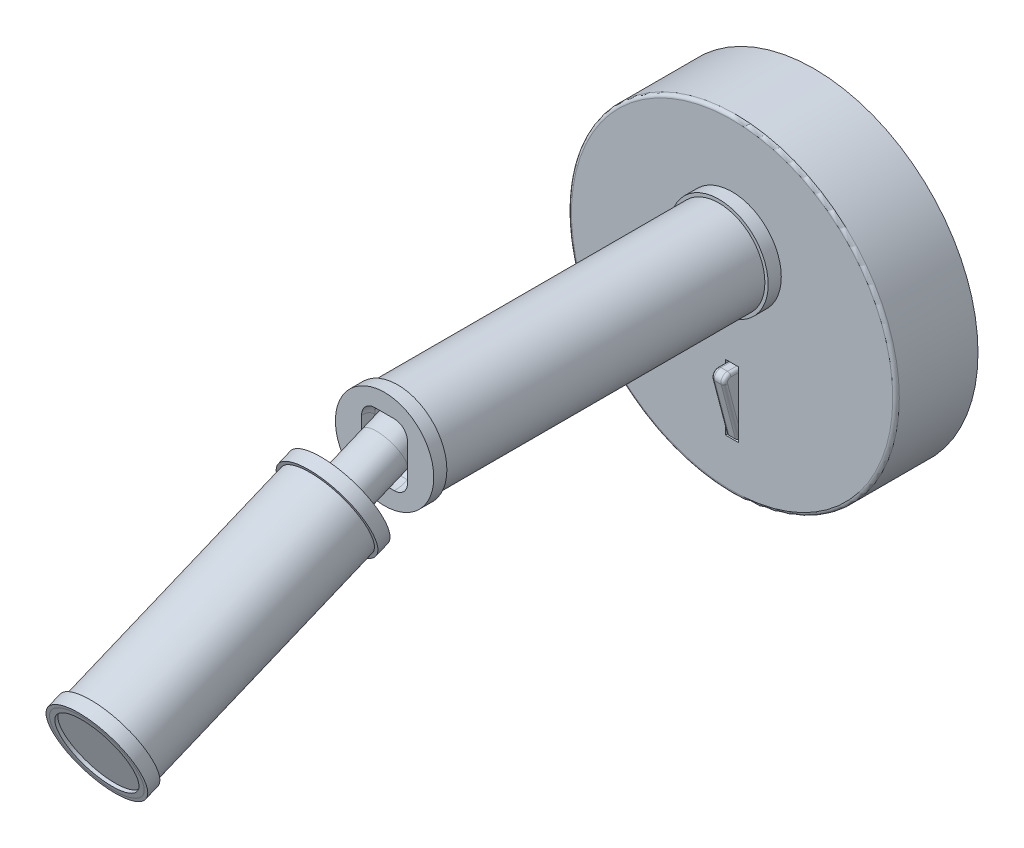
ISO-10303-21;
HEADER;
FILE_DESCRIPTION(('STEP AP214'),'2;1');
FILE_NAME('part.step','',(''),(''),'','','');
FILE_SCHEMA(('AUTOMOTIVE_DESIGN { 1 0 10303 214 1 1 1 1 }'));
ENDSEC;
DATA;
#1=APPLICATION_CONTEXT('core data for automotive mechanical design processes');
#2=APPLICATION_PROTOCOL_DEFINITION('international standard','automotive_design',2000,#1);
#3=PRODUCT_CONTEXT('',#1,'mechanical');
#4=PRODUCT('Part','Part','',(#3));
#5=PRODUCT_RELATED_PRODUCT_CATEGORY('part','',(#4));
#6=PRODUCT_DEFINITION_FORMATION('','',#4);
#7=PRODUCT_DEFINITION_CONTEXT('part definition',#1,'design');
#8=PRODUCT_DEFINITION('design','',#6,#7);
#9=PRODUCT_DEFINITION_SHAPE('','',#8);
#10=(LENGTH_UNIT() NAMED_UNIT(*) SI_UNIT(.MILLI.,.METRE.));
#11=(NAMED_UNIT(*) PLANE_ANGLE_UNIT() SI_UNIT($,.RADIAN.));
#12=(NAMED_UNIT(*) SI_UNIT($,.STERADIAN.) SOLID_ANGLE_UNIT());
#13=UNCERTAINTY_MEASURE_WITH_UNIT(LENGTH_MEASURE(1.E-05),#10,'distance_accuracy_value','');
#14=(GEOMETRIC_REPRESENTATION_CONTEXT(3) GLOBAL_UNCERTAINTY_ASSIGNED_CONTEXT((#13)) GLOBAL_UNIT_ASSIGNED_CONTEXT((#10,
#11,#12)) REPRESENTATION_CONTEXT('',''));
#15=CARTESIAN_POINT('',(0.,0.,0.));
#16=DIRECTION('',(0.,0.,1.));
#17=DIRECTION('',(1.,0.,0.));
#18=AXIS2_PLACEMENT_3D('',#15,#16,#17);
#19=CARTESIAN_POINT('',(0.,7.72169224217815,148.550676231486));
#20=DIRECTION('',(0.,0.383068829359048,-0.923719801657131));
#21=DIRECTION('',(0.,0.923719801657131,0.383068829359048));
#22=AXIS2_PLACEMENT_3D('',#19,#20,#21);
#23=CYLINDRICAL_SURFACE('',#22,14.5);
#24=CARTESIAN_POINT('',(0.,7.72169224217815,148.550676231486));
#25=DIRECTION('',(0.,0.383068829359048,-0.923719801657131));
#26=DIRECTION('',(0.,0.923719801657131,0.383068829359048));
#27=AXIS2_PLACEMENT_3D('',#24,#25,#26);
#28=CIRCLE('',#27,14.5);
#29=CARTESIAN_POINT('',(0.,21.1156293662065,154.105174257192));
#30=VERTEX_POINT('',#29);
#31=EDGE_CURVE('E12',#30,#30,#28,.T.);
#32=ORIENTED_EDGE('',*,*,#31,.T.);
#33=EDGE_LOOP('',(#32));
#34=FACE_BOUND('',#33,.T.);
#35=CARTESIAN_POINT('',(0.,9.25396755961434,144.855797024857));
#36=DIRECTION('',(0.,0.383068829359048,-0.923719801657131));
#37=DIRECTION('',(0.,0.923719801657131,0.383068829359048));
#38=AXIS2_PLACEMENT_3D('',#35,#36,#37);
#39=CIRCLE('',#38,14.5);
#40=CARTESIAN_POINT('',(0.,22.6479046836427,150.410295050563));
#41=VERTEX_POINT('',#40);
#42=EDGE_CURVE('E61',#41,#41,#39,.T.);
#43=ORIENTED_EDGE('',*,*,#42,.F.);
#44=EDGE_LOOP('',(#43));
#45=FACE_BOUND('',#44,.T.);
#46=ADVANCED_FACE('F58',(#34,#45),#23,.T.);
#47=CARTESIAN_POINT('',(0.,7.72169224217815,148.550676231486));
#48=DIRECTION('',(0.,0.383068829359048,-0.923719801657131));
#49=DIRECTION('',(0.,0.923719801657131,0.383068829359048));
#50=AXIS2_PLACEMENT_3D('',#47,#48,#49);
#51=PLANE('',#50);
#52=CARTESIAN_POINT('',(0.,7.72169224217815,148.550676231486));
#53=DIRECTION('',(0.,0.383068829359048,-0.923719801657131));
#54=DIRECTION('',(0.,0.923719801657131,0.383068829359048));
#55=AXIS2_PLACEMENT_3D('',#52,#53,#54);
#56=CIRCLE('',#55,13.5);
#57=CARTESIAN_POINT('',(0.,20.1919095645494,153.722105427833));
#58=VERTEX_POINT('',#57);
#59=EDGE_CURVE('E71',#58,#58,#56,.T.);
#60=ORIENTED_EDGE('',*,*,#59,.T.);
#61=EDGE_LOOP('',(#60));
#62=FACE_BOUND('',#61,.T.);
#63=ORIENTED_EDGE('',*,*,#31,.F.);
#64=EDGE_LOOP('',(#63));
#65=FACE_BOUND('',#64,.T.);
#66=ADVANCED_FACE('F80',(#62,#65),#51,.F.);
#67=CARTESIAN_POINT('',(0.,9.25396755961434,144.855797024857));
#68=DIRECTION('',(0.,0.383068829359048,-0.923719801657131));
#69=DIRECTION('',(0.,0.923719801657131,0.383068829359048));
#70=AXIS2_PLACEMENT_3D('',#67,#68,#69);
#71=PLANE('',#70);
#72=CARTESIAN_POINT('',(0.,9.25396755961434,144.855797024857));
#73=DIRECTION('',(0.,0.383068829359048,-0.923719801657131));
#74=DIRECTION('',(0.,0.923719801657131,0.383068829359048));
#75=AXIS2_PLACEMENT_3D('',#72,#73,#74);
#76=CIRCLE('',#75,13.5);
#77=CARTESIAN_POINT('',(0.,21.7241848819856,150.027226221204));
#78=VERTEX_POINT('',#77);
#79=EDGE_CURVE('E73',#78,#78,#76,.T.);
#80=ORIENTED_EDGE('',*,*,#79,.F.);
#81=EDGE_LOOP('',(#80));
#82=FACE_BOUND('',#81,.T.);
#83=ORIENTED_EDGE('',*,*,#42,.T.);
#84=EDGE_LOOP('',(#83));
#85=FACE_BOUND('',#84,.T.);
#86=ADVANCED_FACE('F86',(#82,#85),#71,.T.);
#87=CARTESIAN_POINT('',(0.,7.72169224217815,148.550676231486));
#88=DIRECTION('',(0.,0.383068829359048,-0.923719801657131));
#89=DIRECTION('',(0.,0.923719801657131,0.383068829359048));
#90=AXIS2_PLACEMENT_3D('',#87,#88,#89);
#91=CYLINDRICAL_SURFACE('',#90,13.5);
#92=ORIENTED_EDGE('',*,*,#59,.F.);
#93=EDGE_LOOP('',(#92));
#94=FACE_BOUND('',#93,.T.);
#95=ORIENTED_EDGE('',*,*,#79,.T.);
#96=EDGE_LOOP('',(#95));
#97=FACE_BOUND('',#96,.T.);
#98=ADVANCED_FACE('F83',(#94,#97),#91,.F.);
#99=CLOSED_SHELL('',(#46,#66,#86,#98));
#100=MANIFOLD_SOLID_BREP('B2',#99);
#101=CARTESIAN_POINT('',(0.,-19.8592634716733,215.058501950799));
#102=DIRECTION('',(0.,-0.383068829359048,0.923719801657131));
#103=DIRECTION('',(0.,-0.923719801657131,-0.383068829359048));
#104=AXIS2_PLACEMENT_3D('',#101,#102,#103);
#105=CYLINDRICAL_SURFACE('',#104,14.5);
#106=CARTESIAN_POINT('',(0.,-19.8592634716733,215.058501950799));
#107=DIRECTION('',(0.,-0.383068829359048,0.923719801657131));
#108=DIRECTION('',(0.,-0.923719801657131,-0.383068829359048));
#109=AXIS2_PLACEMENT_3D('',#106,#107,#108);
#110=CIRCLE('',#109,14.5);
#111=CARTESIAN_POINT('',(0.,-33.2532005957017,209.504003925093));
#112=VERTEX_POINT('',#111);
#113=EDGE_CURVE('E57',#112,#112,#110,.T.);
#114=ORIENTED_EDGE('',*,*,#113,.T.);
#115=EDGE_LOOP('',(#114));
#116=FACE_BOUND('',#115,.T.);
#117=CARTESIAN_POINT('',(0.,-21.3915387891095,218.753381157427));
#118=DIRECTION('',(0.,-0.383068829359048,0.923719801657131));
#119=DIRECTION('',(0.,-0.923719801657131,-0.383068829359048));
#120=AXIS2_PLACEMENT_3D('',#117,#118,#119);
#121=CIRCLE('',#120,14.5);
#122=CARTESIAN_POINT('',(0.,-34.7854759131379,213.198883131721));
#123=VERTEX_POINT('',#122);
#124=EDGE_CURVE('E141',#123,#123,#121,.T.);
#125=ORIENTED_EDGE('',*,*,#124,.F.);
#126=EDGE_LOOP('',(#125));
#127=FACE_BOUND('',#126,.T.);
#128=ADVANCED_FACE('F138',(#116,#127),#105,.T.);
#129=CARTESIAN_POINT('',(0.,-19.8592634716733,215.058501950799));
#130=DIRECTION('',(0.,-0.383068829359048,0.923719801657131));
#131=DIRECTION('',(0.,-0.923719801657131,-0.383068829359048));
#132=AXIS2_PLACEMENT_3D('',#129,#130,#131);
#133=PLANE('',#132);
#134=CARTESIAN_POINT('',(0.,-19.8592634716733,215.058501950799));
#135=DIRECTION('',(0.,-0.383068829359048,0.923719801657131));
#136=DIRECTION('',(0.,-0.923719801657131,-0.383068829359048));
#137=AXIS2_PLACEMENT_3D('',#134,#135,#136);
#138=CIRCLE('',#137,13.5);
#139=CARTESIAN_POINT('',(0.,-32.3294807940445,209.887072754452));
#140=VERTEX_POINT('',#139);
#141=EDGE_CURVE('E150',#140,#140,#138,.T.);
#142=ORIENTED_EDGE('',*,*,#141,.T.);
#143=EDGE_LOOP('',(#142));
#144=FACE_BOUND('',#143,.T.);
#145=ORIENTED_EDGE('',*,*,#113,.F.);
#146=EDGE_LOOP('',(#145));
#147=FACE_BOUND('',#146,.T.);
#148=ADVANCED_FACE('F160',(#144,#147),#133,.F.);
#149=CARTESIAN_POINT('',(0.,-21.3915387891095,218.753381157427));
#150=DIRECTION('',(0.,-0.383068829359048,0.923719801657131));
#151=DIRECTION('',(0.,-0.923719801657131,-0.383068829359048));
#152=AXIS2_PLACEMENT_3D('',#149,#150,#151);
#153=PLANE('',#152);
#154=CARTESIAN_POINT('',(0.,-21.3915387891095,218.753381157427));
#155=DIRECTION('',(0.,-0.383068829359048,0.923719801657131));
#156=DIRECTION('',(0.,-0.923719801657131,-0.383068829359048));
#157=AXIS2_PLACEMENT_3D('',#154,#155,#156);
#158=CIRCLE('',#157,13.5);
#159=CARTESIAN_POINT('',(0.,-33.8617561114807,213.58195196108));
#160=VERTEX_POINT('',#159);
#161=EDGE_CURVE('E152',#160,#160,#158,.T.);
#162=ORIENTED_EDGE('',*,*,#161,.F.);
#163=EDGE_LOOP('',(#162));
#164=FACE_BOUND('',#163,.T.);
#165=ORIENTED_EDGE('',*,*,#124,.T.);
#166=EDGE_LOOP('',(#165));
#167=FACE_BOUND('',#166,.T.);
#168=ADVANCED_FACE('F166',(#164,#167),#153,.T.);
#169=CARTESIAN_POINT('',(0.,-19.8592634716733,215.058501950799));
#170=DIRECTION('',(0.,-0.383068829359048,0.923719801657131));
#171=DIRECTION('',(0.,-0.923719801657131,-0.383068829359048));
#172=AXIS2_PLACEMENT_3D('',#169,#170,#171);
#173=CYLINDRICAL_SURFACE('',#172,13.5);
#174=ORIENTED_EDGE('',*,*,#141,.F.);
#175=EDGE_LOOP('',(#174));
#176=FACE_BOUND('',#175,.T.);
#177=ORIENTED_EDGE('',*,*,#161,.T.);
#178=EDGE_LOOP('',(#177));
#179=FACE_BOUND('',#178,.T.);
#180=ADVANCED_FACE('F163',(#176,#179),#173,.F.);
#181=CLOSED_SHELL('',(#128,#148,#168,#180));
#182=MANIFOLD_SOLID_BREP('B7',#181);
#183=CARTESIAN_POINT('',(2.,-34.8200447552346,20.));
#184=DIRECTION('',(0.,0.,1.));
#185=DIRECTION('',(1.,0.,0.));
#186=AXIS2_PLACEMENT_3D('',#183,#184,#185);
#187=PLANE('',#186);
#188=DIRECTION('',(-1.,0.,0.));
#189=VECTOR('',#188,1.);
#190=CARTESIAN_POINT('',(2.,-15.7428808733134,20.));
#191=LINE('',#190,#189);
#192=CARTESIAN_POINT('',(1.,-15.7428808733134,20.));
#193=VERTEX_POINT('',#192);
#194=CARTESIAN_POINT('',(-1.,-15.7428808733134,20.));
#195=VERTEX_POINT('',#194);
#196=EDGE_CURVE('E327',#193,#195,#191,.T.);
#197=ORIENTED_EDGE('',*,*,#196,.F.);
#198=CARTESIAN_POINT('',(1.,-16.7428808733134,20.));
#199=DIRECTION('',(0.,0.,1.));
#200=DIRECTION('',(1.,0.,0.));
#201=AXIS2_PLACEMENT_3D('',#198,#199,#200);
#202=CIRCLE('',#201,1.);
#203=CARTESIAN_POINT('',(2.,-16.7428808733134,20.));
#204=VERTEX_POINT('',#203);
#205=EDGE_CURVE('E313',#193,#204,#202,.F.);
#206=ORIENTED_EDGE('',*,*,#205,.T.);
#207=DIRECTION('',(0.,1.,0.));
#208=VECTOR('',#207,1.);
#209=CARTESIAN_POINT('',(2.,-34.8200447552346,20.));
#210=LINE('',#209,#208);
#211=CARTESIAN_POINT('',(2.,-34.8200447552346,20.));
#212=VERTEX_POINT('',#211);
#213=EDGE_CURVE('E293',#212,#204,#210,.T.);
#214=ORIENTED_EDGE('',*,*,#213,.F.);
#215=DIRECTION('',(-1.,0.,0.));
#216=VECTOR('',#215,1.);
#217=CARTESIAN_POINT('',(2.,-34.8200447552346,20.));
#218=LINE('',#217,#216);
#219=CARTESIAN_POINT('',(-2.,-34.8200447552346,20.));
#220=VERTEX_POINT('',#219);
#221=EDGE_CURVE('E300',#212,#220,#218,.T.);
#222=ORIENTED_EDGE('',*,*,#221,.T.);
#223=DIRECTION('',(0.,1.,0.));
#224=VECTOR('',#223,1.);
#225=CARTESIAN_POINT('',(-2.,-34.8200447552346,20.));
#226=LINE('',#225,#224);
#227=CARTESIAN_POINT('',(-2.,-16.7428808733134,20.));
#228=VERTEX_POINT('',#227);
#229=EDGE_CURVE('E318',#220,#228,#226,.T.);
#230=ORIENTED_EDGE('',*,*,#229,.T.);
#231=CARTESIAN_POINT('',(-1.,-16.7428808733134,20.));
#232=DIRECTION('',(0.,0.,1.));
#233=DIRECTION('',(1.,0.,0.));
#234=AXIS2_PLACEMENT_3D('',#231,#232,#233);
#235=CIRCLE('',#234,1.);
#236=EDGE_CURVE('E354',#228,#195,#235,.F.);
#237=ORIENTED_EDGE('',*,*,#236,.T.);
#238=EDGE_LOOP('',(#197,#206,#214,#222,#230,#237));
#239=FACE_BOUND('',#238,.T.);
#240=ADVANCED_FACE('F215',(#239),#187,.F.);
#241=CARTESIAN_POINT('',(2.,-15.7428808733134,20.));
#242=DIRECTION('',(0.,-1.,0.));
#243=DIRECTION('',(0.,0.,-1.));
#244=AXIS2_PLACEMENT_3D('',#241,#242,#243);
#245=PLANE('',#244);
#246=DIRECTION('',(-1.,0.,0.));
#247=VECTOR('',#246,1.);
#248=CARTESIAN_POINT('',(2.,-15.7428808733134,27.4082609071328));
#249=LINE('',#248,#247);
#250=CARTESIAN_POINT('',(-1.,-15.7428808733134,27.4082609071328));
#251=VERTEX_POINT('',#250);
#252=CARTESIAN_POINT('',(1.,-15.7428808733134,27.4082609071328));
#253=VERTEX_POINT('',#252);
#254=EDGE_CURVE('E335',#251,#253,#249,.F.);
#255=ORIENTED_EDGE('',*,*,#254,.T.);
#256=DIRECTION('',(0.,0.,1.));
#257=VECTOR('',#256,1.);
#258=CARTESIAN_POINT('',(1.,-15.7428808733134,20.));
#259=LINE('',#258,#257);
#260=EDGE_CURVE('E351',#253,#193,#259,.F.);
#261=ORIENTED_EDGE('',*,*,#260,.T.);
#262=ORIENTED_EDGE('',*,*,#196,.T.);
#263=DIRECTION('',(0.,0.,1.));
#264=VECTOR('',#263,1.);
#265=CARTESIAN_POINT('',(-1.,-15.7428808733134,20.));
#266=LINE('',#265,#264);
#267=EDGE_CURVE('E347',#195,#251,#266,.T.);
#268=ORIENTED_EDGE('',*,*,#267,.T.);
#269=EDGE_LOOP('',(#255,#261,#262,#268));
#270=FACE_BOUND('',#269,.T.);
#271=ADVANCED_FACE('F411',(#270),#245,.F.);
#272=CARTESIAN_POINT('',(2.,-15.7428808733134,30.));
#273=DIRECTION('',(0.,0.253530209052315,-0.967327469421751));
#274=DIRECTION('',(0.,0.967327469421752,0.253530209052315));
#275=AXIS2_PLACEMENT_3D('',#272,#273,#274);
#276=PLANE('',#275);
#277=DIRECTION('',(-1.,0.,0.));
#278=VECTOR('',#277,1.);
#279=CARTESIAN_POINT('',(2.,-34.8200447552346,25.));
#280=LINE('',#279,#278);
#281=CARTESIAN_POINT('',(1.,-34.8200447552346,25.));
#282=VERTEX_POINT('',#281);
#283=CARTESIAN_POINT('',(-1.,-34.8200447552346,25.));
#284=VERTEX_POINT('',#283);
#285=EDGE_CURVE('E309',#282,#284,#280,.T.);
#286=ORIENTED_EDGE('',*,*,#285,.F.);
#287=DIRECTION('',(0.,-0.967327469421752,-0.253530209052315));
#288=VECTOR('',#287,1.);
#289=CARTESIAN_POINT('',(1.,-18.2499412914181,29.3429158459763));
#290=LINE('',#289,#288);
#291=CARTESIAN_POINT('',(1.,-18.2499412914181,29.3429158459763));
#292=VERTEX_POINT('',#291);
#293=EDGE_CURVE('E368',#282,#292,#290,.F.);
#294=ORIENTED_EDGE('',*,*,#293,.T.);
#295=DIRECTION('',(-1.,0.,0.));
#296=VECTOR('',#295,1.);
#297=CARTESIAN_POINT('',(2.,-18.2499412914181,29.3429158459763));
#298=LINE('',#297,#296);
#299=CARTESIAN_POINT('',(-1.,-18.2499412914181,29.3429158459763));
#300=VERTEX_POINT('',#299);
#301=EDGE_CURVE('E331',#292,#300,#298,.T.);
#302=ORIENTED_EDGE('',*,*,#301,.T.);
#303=DIRECTION('',(0.,-0.967327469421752,-0.253530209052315));
#304=VECTOR('',#303,1.);
#305=CARTESIAN_POINT('',(-1.,-15.7428808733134,30.));
#306=LINE('',#305,#304);
#307=EDGE_CURVE('E365',#300,#284,#306,.T.);
#308=ORIENTED_EDGE('',*,*,#307,.T.);
#309=EDGE_LOOP('',(#286,#294,#302,#308));
#310=FACE_BOUND('',#309,.T.);
#311=ADVANCED_FACE('F399',(#310),#276,.F.);
#312=CARTESIAN_POINT('',(2.,-34.8200447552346,25.));
#313=DIRECTION('',(0.,1.,0.));
#314=DIRECTION('',(0.,0.,1.));
#315=AXIS2_PLACEMENT_3D('',#312,#313,#314);
#316=PLANE('',#315);
#317=DIRECTION('',(0.,0.,-1.));
#318=VECTOR('',#317,1.);
#319=CARTESIAN_POINT('',(2.,-34.8200447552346,25.));
#320=LINE('',#319,#318);
#321=CARTESIAN_POINT('',(2.,-34.8200447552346,23.9662239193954));
#322=VERTEX_POINT('',#321);
#323=EDGE_CURVE('E288',#322,#212,#320,.T.);
#324=ORIENTED_EDGE('',*,*,#323,.F.);
#325=CARTESIAN_POINT('',(1.,-34.8200447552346,23.9662239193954));
#326=DIRECTION('',(0.,1.,0.));
#327=DIRECTION('',(0.,0.,1.));
#328=AXIS2_PLACEMENT_3D('',#325,#326,#327);
#329=ELLIPSE('',#328,1.03377608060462,1.);
#330=EDGE_CURVE('E362',#322,#282,#329,.F.);
#331=ORIENTED_EDGE('',*,*,#330,.T.);
#332=ORIENTED_EDGE('',*,*,#285,.T.);
#333=CARTESIAN_POINT('',(-1.,-34.8200447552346,23.9662239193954));
#334=DIRECTION('',(0.,1.,0.));
#335=DIRECTION('',(0.,0.,-1.));
#336=AXIS2_PLACEMENT_3D('',#333,#334,#335);
#337=ELLIPSE('',#336,1.03377608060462,1.);
#338=CARTESIAN_POINT('',(-2.,-34.8200447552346,23.9662239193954));
#339=VERTEX_POINT('',#338);
#340=EDGE_CURVE('E359',#284,#339,#337,.F.);
#341=ORIENTED_EDGE('',*,*,#340,.T.);
#342=DIRECTION('',(0.,0.,-1.));
#343=VECTOR('',#342,1.);
#344=CARTESIAN_POINT('',(-2.,-34.8200447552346,25.));
#345=LINE('',#344,#343);
#346=EDGE_CURVE('E304',#339,#220,#345,.T.);
#347=ORIENTED_EDGE('',*,*,#346,.T.);
#348=ORIENTED_EDGE('',*,*,#221,.F.);
#349=EDGE_LOOP('',(#324,#331,#332,#341,#347,#348));
#350=FACE_BOUND('',#349,.T.);
#351=ADVANCED_FACE('F303',(#350),#316,.F.);
#352=CARTESIAN_POINT('',(2.,0.,0.));
#353=DIRECTION('',(1.,0.,0.));
#354=DIRECTION('',(0.,0.,-1.));
#355=AXIS2_PLACEMENT_3D('',#352,#353,#354);
#356=PLANE('',#355);
#357=ORIENTED_EDGE('',*,*,#213,.T.);
#358=DIRECTION('',(0.,0.,1.));
#359=VECTOR('',#358,1.);
#360=CARTESIAN_POINT('',(2.,-16.7428808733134,27.4082609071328));
#361=LINE('',#360,#359);
#362=CARTESIAN_POINT('',(2.,-16.7428808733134,27.4082609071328));
#363=VERTEX_POINT('',#362);
#364=EDGE_CURVE('E344',#204,#363,#361,.T.);
#365=ORIENTED_EDGE('',*,*,#364,.T.);
#366=CARTESIAN_POINT('',(2.,-17.7428808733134,27.4082609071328));
#367=DIRECTION('',(1.,0.,0.));
#368=DIRECTION('',(0.,0.,-1.));
#369=AXIS2_PLACEMENT_3D('',#366,#367,#368);
#370=CIRCLE('',#369,1.);
#371=CARTESIAN_POINT('',(2.,-17.9964110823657,28.3755883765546));
#372=VERTEX_POINT('',#371);
#373=EDGE_CURVE('E339',#363,#372,#370,.T.);
#374=ORIENTED_EDGE('',*,*,#373,.T.);
#375=DIRECTION('',(0.,-0.967327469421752,-0.253530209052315));
#376=VECTOR('',#375,1.);
#377=CARTESIAN_POINT('',(2.,-34.5665145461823,24.0326725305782));
#378=LINE('',#377,#376);
#379=EDGE_CURVE('E296',#372,#322,#378,.T.);
#380=ORIENTED_EDGE('',*,*,#379,.T.);
#381=ORIENTED_EDGE('',*,*,#323,.T.);
#382=EDGE_LOOP('',(#357,#365,#374,#380,#381));
#383=FACE_BOUND('',#382,.T.);
#384=ADVANCED_FACE('F290',(#383),#356,.T.);
#385=CARTESIAN_POINT('',(-2.,0.,0.));
#386=DIRECTION('',(1.,0.,0.));
#387=DIRECTION('',(0.,0.,-1.));
#388=AXIS2_PLACEMENT_3D('',#385,#386,#387);
#389=PLANE('',#388);
#390=CARTESIAN_POINT('',(-2.,-17.7428808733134,27.4082609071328));
#391=DIRECTION('',(1.,0.,0.));
#392=DIRECTION('',(0.,0.,-1.));
#393=AXIS2_PLACEMENT_3D('',#390,#391,#392);
#394=CIRCLE('',#393,1.);
#395=CARTESIAN_POINT('',(-2.,-17.9964110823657,28.3755883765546));
#396=VERTEX_POINT('',#395);
#397=CARTESIAN_POINT('',(-2.,-16.7428808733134,27.4082609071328));
#398=VERTEX_POINT('',#397);
#399=EDGE_CURVE('E233',#396,#398,#394,.F.);
#400=ORIENTED_EDGE('',*,*,#399,.T.);
#401=DIRECTION('',(0.,0.,1.));
#402=VECTOR('',#401,1.);
#403=CARTESIAN_POINT('',(-2.,-16.7428808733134,0.));
#404=LINE('',#403,#402);
#405=EDGE_CURVE('E375',#398,#228,#404,.F.);
#406=ORIENTED_EDGE('',*,*,#405,.T.);
#407=ORIENTED_EDGE('',*,*,#229,.F.);
#408=ORIENTED_EDGE('',*,*,#346,.F.);
#409=DIRECTION('',(0.,-0.967327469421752,-0.253530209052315));
#410=VECTOR('',#409,1.);
#411=CARTESIAN_POINT('',(-2.,-8.11578593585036,30.9652356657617));
#412=LINE('',#411,#410);
#413=EDGE_CURVE('E238',#339,#396,#412,.F.);
#414=ORIENTED_EDGE('',*,*,#413,.T.);
#415=EDGE_LOOP('',(#400,#406,#407,#408,#414));
#416=FACE_BOUND('',#415,.T.);
#417=ADVANCED_FACE('F435',(#416),#389,.F.);
#418=CARTESIAN_POINT('',(2.,-17.7428808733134,27.4082609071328));
#419=DIRECTION('',(-1.,0.,0.));
#420=DIRECTION('',(0.,0.,1.));
#421=AXIS2_PLACEMENT_3D('',#418,#419,#420);
#422=CYLINDRICAL_SURFACE('',#421,2.);
#423=ORIENTED_EDGE('',*,*,#254,.F.);
#424=CARTESIAN_POINT('',(-1.,-17.7428808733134,27.4082609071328));
#425=DIRECTION('',(1.,0.,0.));
#426=DIRECTION('',(0.,0.,-1.));
#427=AXIS2_PLACEMENT_3D('',#424,#425,#426);
#428=CIRCLE('',#427,2.);
#429=EDGE_CURVE('E136',#251,#300,#428,.T.);
#430=ORIENTED_EDGE('',*,*,#429,.T.);
#431=ORIENTED_EDGE('',*,*,#301,.F.);
#432=CARTESIAN_POINT('',(1.,-17.7428808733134,27.4082609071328));
#433=DIRECTION('',(1.,0.,0.));
#434=DIRECTION('',(0.,0.,-1.));
#435=AXIS2_PLACEMENT_3D('',#432,#433,#434);
#436=CIRCLE('',#435,2.);
#437=EDGE_CURVE('E225',#292,#253,#436,.F.);
#438=ORIENTED_EDGE('',*,*,#437,.T.);
#439=EDGE_LOOP('',(#423,#430,#431,#438));
#440=FACE_BOUND('',#439,.T.);
#441=ADVANCED_FACE('F408',(#440),#422,.T.);
#442=CARTESIAN_POINT('',(1.,-8.11578593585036,30.9652356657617));
#443=DIRECTION('',(0.,0.967327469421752,0.253530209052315));
#444=DIRECTION('',(0.,-0.253530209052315,0.967327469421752));
#445=AXIS2_PLACEMENT_3D('',#442,#443,#444);
#446=CYLINDRICAL_SURFACE('',#445,1.);
#447=ORIENTED_EDGE('',*,*,#330,.F.);
#448=ORIENTED_EDGE('',*,*,#379,.F.);
#449=CARTESIAN_POINT('',(1.,-17.9964110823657,28.3755883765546));
#450=DIRECTION('',(0.,0.967327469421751,0.253530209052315));
#451=DIRECTION('',(0.,-0.253530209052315,0.967327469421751));
#452=AXIS2_PLACEMENT_3D('',#449,#450,#451);
#453=CIRCLE('',#452,1.);
#454=EDGE_CURVE('E322',#292,#372,#453,.T.);
#455=ORIENTED_EDGE('',*,*,#454,.F.);
#456=ORIENTED_EDGE('',*,*,#293,.F.);
#457=EDGE_LOOP('',(#447,#448,#455,#456));
#458=FACE_BOUND('',#457,.T.);
#459=ADVANCED_FACE('F403',(#458),#446,.T.);
#460=CARTESIAN_POINT('',(1.,-17.7428808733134,27.4082609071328));
#461=DIRECTION('',(1.,0.,0.));
#462=DIRECTION('',(0.,0.,-1.));
#463=AXIS2_PLACEMENT_3D('',#460,#461,#462);
#464=DEGENERATE_TOROIDAL_SURFACE('',#463,1.,1.,.T.);
#465=ORIENTED_EDGE('',*,*,#454,.T.);
#466=ORIENTED_EDGE('',*,*,#373,.F.);
#467=CARTESIAN_POINT('',(1.,-16.7428808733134,27.4082609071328));
#468=DIRECTION('',(0.,0.,-1.));
#469=DIRECTION('',(-1.,0.,0.));
#470=AXIS2_PLACEMENT_3D('',#467,#468,#469);
#471=CIRCLE('',#470,1.);
#472=EDGE_CURVE('E379',#253,#363,#471,.T.);
#473=ORIENTED_EDGE('',*,*,#472,.F.);
#474=ORIENTED_EDGE('',*,*,#437,.F.);
#475=EDGE_LOOP('',(#465,#466,#473,#474));
#476=FACE_BOUND('',#475,.T.);
#477=ADVANCED_FACE('F417',(#476),#464,.T.);
#478=CARTESIAN_POINT('',(1.,-16.7428808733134,0.));
#479=DIRECTION('',(0.,0.,-1.));
#480=DIRECTION('',(-1.,0.,0.));
#481=AXIS2_PLACEMENT_3D('',#478,#479,#480);
#482=CYLINDRICAL_SURFACE('',#481,1.);
#483=ORIENTED_EDGE('',*,*,#205,.F.);
#484=ORIENTED_EDGE('',*,*,#260,.F.);
#485=ORIENTED_EDGE('',*,*,#472,.T.);
#486=ORIENTED_EDGE('',*,*,#364,.F.);
#487=EDGE_LOOP('',(#483,#484,#485,#486));
#488=FACE_BOUND('',#487,.T.);
#489=ADVANCED_FACE('F414',(#488),#482,.T.);
#490=CARTESIAN_POINT('',(-1.,-15.4893506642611,29.0326725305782));
#491=DIRECTION('',(0.,-0.967327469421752,-0.253530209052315));
#492=DIRECTION('',(0.,0.253530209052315,-0.967327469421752));
#493=AXIS2_PLACEMENT_3D('',#490,#491,#492);
#494=CYLINDRICAL_SURFACE('',#493,1.);
#495=ORIENTED_EDGE('',*,*,#340,.F.);
#496=ORIENTED_EDGE('',*,*,#307,.F.);
#497=CARTESIAN_POINT('',(-1.,-17.9964110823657,28.3755883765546));
#498=DIRECTION('',(0.,0.967327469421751,0.253530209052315));
#499=DIRECTION('',(0.,-0.253530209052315,0.967327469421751));
#500=AXIS2_PLACEMENT_3D('',#497,#498,#499);
#501=CIRCLE('',#500,1.);
#502=EDGE_CURVE('E219',#396,#300,#501,.T.);
#503=ORIENTED_EDGE('',*,*,#502,.F.);
#504=ORIENTED_EDGE('',*,*,#413,.F.);
#505=EDGE_LOOP('',(#495,#496,#503,#504));
#506=FACE_BOUND('',#505,.T.);
#507=ADVANCED_FACE('F217',(#506),#494,.T.);
#508=CARTESIAN_POINT('',(-1.,-17.7428808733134,27.4082609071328));
#509=DIRECTION('',(1.,0.,0.));
#510=DIRECTION('',(0.,0.,-1.));
#511=AXIS2_PLACEMENT_3D('',#508,#509,#510);
#512=DEGENERATE_TOROIDAL_SURFACE('',#511,1.,1.,.T.);
#513=ORIENTED_EDGE('',*,*,#502,.T.);
#514=ORIENTED_EDGE('',*,*,#429,.F.);
#515=CARTESIAN_POINT('',(-1.,-16.7428808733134,27.4082609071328));
#516=DIRECTION('',(0.,0.,-1.));
#517=DIRECTION('',(-1.,0.,0.));
#518=AXIS2_PLACEMENT_3D('',#515,#516,#517);
#519=CIRCLE('',#518,1.);
#520=EDGE_CURVE('E384',#398,#251,#519,.T.);
#521=ORIENTED_EDGE('',*,*,#520,.F.);
#522=ORIENTED_EDGE('',*,*,#399,.F.);
#523=EDGE_LOOP('',(#513,#514,#521,#522));
#524=FACE_BOUND('',#523,.T.);
#525=ADVANCED_FACE('F393',(#524),#512,.T.);
#526=CARTESIAN_POINT('',(-1.,-16.7428808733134,20.));
#527=DIRECTION('',(0.,0.,1.));
#528=DIRECTION('',(1.,0.,0.));
#529=AXIS2_PLACEMENT_3D('',#526,#527,#528);
#530=CYLINDRICAL_SURFACE('',#529,1.);
#531=ORIENTED_EDGE('',*,*,#236,.F.);
#532=ORIENTED_EDGE('',*,*,#405,.F.);
#533=ORIENTED_EDGE('',*,*,#520,.T.);
#534=ORIENTED_EDGE('',*,*,#267,.F.);
#535=EDGE_LOOP('',(#531,#532,#533,#534));
#536=FACE_BOUND('',#535,.T.);
#537=ADVANCED_FACE('F489',(#536),#530,.T.);
#538=CLOSED_SHELL('',(#240,#271,#311,#351,#384,#417,#441,#459,#477,#489,#507,#525,#537));
#539=MANIFOLD_SOLID_BREP('B52',#538);
#540=CARTESIAN_POINT('',(0.,-21.0084699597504,217.82966135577));
#541=DIRECTION('',(0.,0.383068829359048,-0.923719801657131));
#542=DIRECTION('',(0.,0.923719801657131,0.383068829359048));
#543=AXIS2_PLACEMENT_3D('',#540,#541,#542);
#544=CYLINDRICAL_SURFACE('',#543,12.);
#545=CARTESIAN_POINT('',(0.,-21.0084699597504,217.82966135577));
#546=DIRECTION('',(0.,-0.383068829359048,0.923719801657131));
#547=DIRECTION('',(0.,-0.923719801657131,-0.383068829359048));
#548=AXIS2_PLACEMENT_3D('',#545,#546,#547);
#549=CIRCLE('',#548,12.);
#550=CARTESIAN_POINT('',(0.,-32.093107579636,213.232835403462));
#551=VERTEX_POINT('',#550);
#552=EDGE_CURVE('E214',#551,#551,#549,.T.);
#553=ORIENTED_EDGE('',*,*,#552,.F.);
#554=EDGE_LOOP('',(#553));
#555=FACE_BOUND('',#554,.T.);
#556=CARTESIAN_POINT('',(0.,-20.6254011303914,216.905941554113));
#557=DIRECTION('',(0.,-0.383068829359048,0.923719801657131));
#558=DIRECTION('',(0.,-0.923719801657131,-0.383068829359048));
#559=AXIS2_PLACEMENT_3D('',#556,#557,#558);
#560=CIRCLE('',#559,12.);
#561=CARTESIAN_POINT('',(0.,-31.710038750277,212.309115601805));
#562=VERTEX_POINT('',#561);
#563=EDGE_CURVE('E553',#562,#562,#560,.T.);
#564=ORIENTED_EDGE('',*,*,#563,.T.);
#565=EDGE_LOOP('',(#564));
#566=FACE_BOUND('',#565,.T.);
#567=ADVANCED_FACE('F550',(#555,#566),#544,.T.);
#568=CARTESIAN_POINT('',(0.,-21.0084699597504,217.82966135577));
#569=DIRECTION('',(0.,-0.383068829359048,0.923719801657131));
#570=DIRECTION('',(0.,-0.923719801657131,-0.383068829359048));
#571=AXIS2_PLACEMENT_3D('',#568,#569,#570);
#572=PLANE('',#571);
#573=ORIENTED_EDGE('',*,*,#552,.T.);
#574=EDGE_LOOP('',(#573));
#575=FACE_BOUND('',#574,.T.);
#576=ADVANCED_FACE('F567',(#575),#572,.T.);
#577=CARTESIAN_POINT('',(0.,-20.6254011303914,216.905941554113));
#578=DIRECTION('',(0.,-0.383068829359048,0.923719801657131));
#579=DIRECTION('',(0.,-0.923719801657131,-0.383068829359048));
#580=AXIS2_PLACEMENT_3D('',#577,#578,#579);
#581=PLANE('',#580);
#582=ORIENTED_EDGE('',*,*,#563,.F.);
#583=EDGE_LOOP('',(#582));
#584=FACE_BOUND('',#583,.T.);
#585=ADVANCED_FACE('F565',(#584),#581,.F.);
#586=CLOSED_SHELL('',(#567,#576,#585));
#587=MANIFOLD_SOLID_BREP('B130',#586);
#588=CARTESIAN_POINT('',(0.,-21.3915387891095,218.753381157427));
#589=DIRECTION('',(0.,0.383068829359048,-0.923719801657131));
#590=DIRECTION('',(0.,0.923719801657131,0.383068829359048));
#591=AXIS2_PLACEMENT_3D('',#588,#589,#590);
#592=CYLINDRICAL_SURFACE('',#591,13.5);
#593=CARTESIAN_POINT('',(0.,-21.3915387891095,218.753381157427));
#594=DIRECTION('',(0.,-0.383068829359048,0.923719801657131));
#595=DIRECTION('',(0.,-0.923719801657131,-0.383068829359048));
#596=AXIS2_PLACEMENT_3D('',#593,#594,#595);
#597=CIRCLE('',#596,13.5);
#598=CARTESIAN_POINT('',(0.,-33.8617561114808,213.58195196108));
#599=VERTEX_POINT('',#598);
#600=EDGE_CURVE('E549',#599,#599,#597,.T.);
#601=ORIENTED_EDGE('',*,*,#600,.F.);
#602=EDGE_LOOP('',(#601));
#603=FACE_BOUND('',#602,.T.);
#604=CARTESIAN_POINT('',(0.,9.25396755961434,144.855797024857));
#605=DIRECTION('',(0.,-0.383068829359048,0.923719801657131));
#606=DIRECTION('',(0.,-0.923719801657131,-0.383068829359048));
#607=AXIS2_PLACEMENT_3D('',#604,#605,#606);
#608=CIRCLE('',#607,13.5);
#609=CARTESIAN_POINT('',(0.,-3.21624976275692,139.68436782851));
#610=VERTEX_POINT('',#609);
#611=EDGE_CURVE('E608',#610,#610,#608,.T.);
#612=ORIENTED_EDGE('',*,*,#611,.T.);
#613=EDGE_LOOP('',(#612));
#614=FACE_BOUND('',#613,.T.);
#615=ADVANCED_FACE('F605',(#603,#614),#592,.T.);
#616=CARTESIAN_POINT('',(0.,-21.3915387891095,218.753381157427));
#617=DIRECTION('',(0.,-0.383068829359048,0.923719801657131));
#618=DIRECTION('',(0.,-0.923719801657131,-0.383068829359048));
#619=AXIS2_PLACEMENT_3D('',#616,#617,#618);
#620=PLANE('',#619);
#621=CARTESIAN_POINT('',(0.,-21.3915387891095,218.753381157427));
#622=DIRECTION('',(0.,-0.383068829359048,0.923719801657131));
#623=DIRECTION('',(0.,-0.923719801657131,-0.383068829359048));
#624=AXIS2_PLACEMENT_3D('',#621,#622,#623);
#625=CIRCLE('',#624,12.);
#626=CARTESIAN_POINT('',(0.,-32.4761764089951,214.156555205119));
#627=VERTEX_POINT('',#626);
#628=EDGE_CURVE('E620',#627,#627,#625,.T.);
#629=ORIENTED_EDGE('',*,*,#628,.F.);
#630=EDGE_LOOP('',(#629));
#631=FACE_BOUND('',#630,.T.);
#632=ORIENTED_EDGE('',*,*,#600,.T.);
#633=EDGE_LOOP('',(#632));
#634=FACE_BOUND('',#633,.T.);
#635=ADVANCED_FACE('F636',(#631,#634),#620,.T.);
#636=CARTESIAN_POINT('',(0.,9.25396755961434,144.855797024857));
#637=DIRECTION('',(0.,-0.383068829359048,0.923719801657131));
#638=DIRECTION('',(0.,-0.923719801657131,-0.383068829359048));
#639=AXIS2_PLACEMENT_3D('',#636,#637,#638);
#640=PLANE('',#639);
#641=ORIENTED_EDGE('',*,*,#611,.F.);
#642=EDGE_LOOP('',(#641));
#643=FACE_BOUND('',#642,.T.);
#644=ADVANCED_FACE('F632',(#643),#640,.F.);
#645=CARTESIAN_POINT('',(0.,-20.6254011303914,216.905941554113));
#646=DIRECTION('',(0.,-0.383068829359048,0.923719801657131));
#647=DIRECTION('',(0.,-0.923719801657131,-0.383068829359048));
#648=AXIS2_PLACEMENT_3D('',#645,#646,#647);
#649=CYLINDRICAL_SURFACE('',#648,12.);
#650=CARTESIAN_POINT('',(0.,-20.6254011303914,216.905941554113));
#651=DIRECTION('',(0.,-0.383068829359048,0.923719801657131));
#652=DIRECTION('',(0.,-0.923719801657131,-0.383068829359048));
#653=AXIS2_PLACEMENT_3D('',#650,#651,#652);
#654=CIRCLE('',#653,12.);
#655=CARTESIAN_POINT('',(0.,-31.710038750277,212.309115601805));
#656=VERTEX_POINT('',#655);
#657=EDGE_CURVE('E618',#656,#656,#654,.T.);
#658=ORIENTED_EDGE('',*,*,#657,.F.);
#659=EDGE_LOOP('',(#658));
#660=FACE_BOUND('',#659,.T.);
#661=ORIENTED_EDGE('',*,*,#628,.T.);
#662=EDGE_LOOP('',(#661));
#663=FACE_BOUND('',#662,.T.);
#664=ADVANCED_FACE('F629',(#660,#663),#649,.F.);
#665=CARTESIAN_POINT('',(0.,-20.6254011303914,216.905941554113));
#666=DIRECTION('',(0.,-0.383068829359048,0.923719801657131));
#667=DIRECTION('',(0.,-0.923719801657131,-0.383068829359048));
#668=AXIS2_PLACEMENT_3D('',#665,#666,#667);
#669=PLANE('',#668);
#670=ORIENTED_EDGE('',*,*,#657,.T.);
#671=EDGE_LOOP('',(#670));
#672=FACE_BOUND('',#671,.T.);
#673=ADVANCED_FACE('F627',(#672),#669,.T.);
#674=CLOSED_SHELL('',(#615,#635,#644,#664,#673));
#675=MANIFOLD_SOLID_BREP('B209',#674);
#676=CARTESIAN_POINT('',(0.,20.5883022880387,117.52454836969));
#677=DIRECTION('',(0.,-0.383068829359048,0.923719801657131));
#678=DIRECTION('',(0.,-0.923719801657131,-0.383068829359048));
#679=AXIS2_PLACEMENT_3D('',#676,#677,#678);
#680=PLANE('',#679);
#681=CARTESIAN_POINT('',(0.,20.5883022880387,117.52454836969));
#682=DIRECTION('',(0.,-0.383068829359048,0.923719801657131));
#683=DIRECTION('',(0.,-0.923719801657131,-0.383068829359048));
#684=AXIS2_PLACEMENT_3D('',#681,#682,#683);
#685=CIRCLE('',#684,6.5);
#686=CARTESIAN_POINT('',(0.,14.5841235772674,115.034600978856));
#687=VERTEX_POINT('',#686);
#688=EDGE_CURVE('E707',#687,#687,#685,.T.);
#689=ORIENTED_EDGE('',*,*,#688,.F.);
#690=EDGE_LOOP('',(#689));
#691=FACE_BOUND('',#690,.T.);
#692=ADVANCED_FACE('F694',(#691),#680,.F.);
#693=CARTESIAN_POINT('',(0.,9.25396755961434,144.855797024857));
#694=DIRECTION('',(0.,-0.383068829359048,0.923719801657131));
#695=DIRECTION('',(0.,-0.923719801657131,-0.383068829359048));
#696=AXIS2_PLACEMENT_3D('',#693,#694,#695);
#697=PLANE('',#696);
#698=CARTESIAN_POINT('',(0.,9.25396755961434,144.855797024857));
#699=DIRECTION('',(0.,-0.383068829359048,0.923719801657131));
#700=DIRECTION('',(0.,-0.923719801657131,-0.383068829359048));
#701=AXIS2_PLACEMENT_3D('',#698,#699,#700);
#702=CIRCLE('',#701,6.5);
#703=CARTESIAN_POINT('',(0.,3.24978884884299,142.365849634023));
#704=VERTEX_POINT('',#703);
#705=EDGE_CURVE('E603',#704,#704,#702,.T.);
#706=ORIENTED_EDGE('',*,*,#705,.T.);
#707=EDGE_LOOP('',(#706));
#708=FACE_BOUND('',#707,.T.);
#709=ADVANCED_FACE('F710',(#708),#697,.T.);
#710=CARTESIAN_POINT('',(0.,20.5883022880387,117.52454836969));
#711=DIRECTION('',(0.,-0.383068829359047,0.923719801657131));
#712=DIRECTION('',(0.,-0.923719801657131,-0.383068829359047));
#713=AXIS2_PLACEMENT_3D('',#710,#711,#712);
#714=CYLINDRICAL_SURFACE('',#713,6.5);
#715=CARTESIAN_POINT('',(0.,15.,131.));
#716=DIRECTION('',(0.,-0.383068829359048,0.923719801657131));
#717=DIRECTION('',(0.,-0.923719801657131,-0.383068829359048));
#718=AXIS2_PLACEMENT_3D('',#715,#716,#717);
#719=CIRCLE('',#718,6.5);
#720=CARTESIAN_POINT('',(0.,8.99582128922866,128.510052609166));
#721=VERTEX_POINT('',#720);
#722=EDGE_CURVE('E702',#721,#721,#719,.T.);
#723=ORIENTED_EDGE('',*,*,#722,.F.);
#724=EDGE_LOOP('',(#723));
#725=FACE_BOUND('',#724,.T.);
#726=ORIENTED_EDGE('',*,*,#688,.T.);
#727=EDGE_LOOP('',(#726));
#728=FACE_BOUND('',#727,.T.);
#729=ADVANCED_FACE('F715',(#725,#728),#714,.T.);
#730=CARTESIAN_POINT('',(0.,15.,131.));
#731=DIRECTION('',(0.,-0.383068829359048,0.923719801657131));
#732=DIRECTION('',(0.,-0.923719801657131,-0.383068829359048));
#733=AXIS2_PLACEMENT_3D('',#730,#731,#732);
#734=CYLINDRICAL_SURFACE('',#733,6.5);
#735=ORIENTED_EDGE('',*,*,#705,.F.);
#736=EDGE_LOOP('',(#735));
#737=FACE_BOUND('',#736,.T.);
#738=ORIENTED_EDGE('',*,*,#722,.T.);
#739=EDGE_LOOP('',(#738));
#740=FACE_BOUND('',#739,.T.);
#741=ADVANCED_FACE('F712',(#737,#740),#734,.T.);
#742=CLOSED_SHELL('',(#692,#709,#729,#741));
#743=MANIFOLD_SOLID_BREP('B544',#742);
#744=CARTESIAN_POINT('',(0.,15.,131.));
#745=DIRECTION('',(0.,0.,1.));
#746=DIRECTION('',(1.,0.,0.));
#747=AXIS2_PLACEMENT_3D('',#744,#745,#746);
#748=PLANE('',#747);
#749=CARTESIAN_POINT('',(0.,15.,131.));
#750=DIRECTION('',(0.,0.,1.));
#751=DIRECTION('',(1.,0.,0.));
#752=AXIS2_PLACEMENT_3D('',#749,#750,#751);
#753=CIRCLE('',#752,15.);
#754=CARTESIAN_POINT('',(15.,15.,131.));
#755=VERTEX_POINT('',#754);
#756=EDGE_CURVE('E929',#755,#755,#753,.T.);
#757=ORIENTED_EDGE('',*,*,#756,.T.);
#758=EDGE_LOOP('',(#757));
#759=FACE_BOUND('',#758,.T.);
#760=DIRECTION('',(1.,0.,0.));
#761=VECTOR('',#760,1.);
#762=CARTESIAN_POINT('',(-7.,5.51115208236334,131.));
#763=LINE('',#762,#761);
#764=CARTESIAN_POINT('',(-3.,5.51115208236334,131.));
#765=VERTEX_POINT('',#764);
#766=CARTESIAN_POINT('',(3.,5.51115208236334,131.));
#767=VERTEX_POINT('',#766);
#768=EDGE_CURVE('E846',#765,#767,#763,.T.);
#769=ORIENTED_EDGE('',*,*,#768,.F.);
#770=CARTESIAN_POINT('',(-3.,9.51115208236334,131.));
#771=DIRECTION('',(0.,0.,1.));
#772=DIRECTION('',(1.,0.,0.));
#773=AXIS2_PLACEMENT_3D('',#770,#771,#772);
#774=CIRCLE('',#773,4.);
#775=CARTESIAN_POINT('',(-7.,9.51115208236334,131.));
#776=VERTEX_POINT('',#775);
#777=EDGE_CURVE('E858',#765,#776,#774,.F.);
#778=ORIENTED_EDGE('',*,*,#777,.T.);
#779=DIRECTION('',(0.,1.,0.));
#780=VECTOR('',#779,1.);
#781=CARTESIAN_POINT('',(-7.,15.,131.));
#782=LINE('',#781,#780);
#783=CARTESIAN_POINT('',(-7.,20.4888479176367,131.));
#784=VERTEX_POINT('',#783);
#785=EDGE_CURVE('E957',#776,#784,#782,.T.);
#786=ORIENTED_EDGE('',*,*,#785,.T.);
#787=CARTESIAN_POINT('',(-3.,20.4888479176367,131.));
#788=DIRECTION('',(0.,0.,1.));
#789=DIRECTION('',(1.,0.,0.));
#790=AXIS2_PLACEMENT_3D('',#787,#788,#789);
#791=CIRCLE('',#790,4.);
#792=CARTESIAN_POINT('',(-3.,24.4888479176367,131.));
#793=VERTEX_POINT('',#792);
#794=EDGE_CURVE('E783',#784,#793,#791,.F.);
#795=ORIENTED_EDGE('',*,*,#794,.T.);
#796=DIRECTION('',(1.,0.,0.));
#797=VECTOR('',#796,1.);
#798=CARTESIAN_POINT('',(-7.,24.4888479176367,131.));
#799=LINE('',#798,#797);
#800=CARTESIAN_POINT('',(3.,24.4888479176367,131.));
#801=VERTEX_POINT('',#800);
#802=EDGE_CURVE('E865',#801,#793,#799,.F.);
#803=ORIENTED_EDGE('',*,*,#802,.F.);
#804=CARTESIAN_POINT('',(3.,20.4888479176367,131.));
#805=DIRECTION('',(0.,0.,1.));
#806=DIRECTION('',(1.,0.,0.));
#807=AXIS2_PLACEMENT_3D('',#804,#805,#806);
#808=CIRCLE('',#807,4.);
#809=CARTESIAN_POINT('',(7.,20.4888479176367,131.));
#810=VERTEX_POINT('',#809);
#811=EDGE_CURVE('E872',#801,#810,#808,.F.);
#812=ORIENTED_EDGE('',*,*,#811,.T.);
#813=DIRECTION('',(0.,1.,0.));
#814=VECTOR('',#813,1.);
#815=CARTESIAN_POINT('',(7.,15.,131.));
#816=LINE('',#815,#814);
#817=CARTESIAN_POINT('',(7.,9.51115208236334,131.));
#818=VERTEX_POINT('',#817);
#819=EDGE_CURVE('E960',#818,#810,#816,.T.);
#820=ORIENTED_EDGE('',*,*,#819,.F.);
#821=CARTESIAN_POINT('',(3.,9.51115208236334,131.));
#822=DIRECTION('',(0.,0.,1.));
#823=DIRECTION('',(1.,0.,0.));
#824=AXIS2_PLACEMENT_3D('',#821,#822,#823);
#825=CIRCLE('',#824,4.);
#826=EDGE_CURVE('E862',#818,#767,#825,.F.);
#827=ORIENTED_EDGE('',*,*,#826,.T.);
#828=EDGE_LOOP('',(#769,#778,#786,#795,#803,#812,#820,#827));
#829=FACE_BOUND('',#828,.T.);
#830=ADVANCED_FACE('F768',(#759,#829),#748,.T.);
#831=CARTESIAN_POINT('',(0.,15.,127.));
#832=DIRECTION('',(0.,0.,1.));
#833=DIRECTION('',(1.,0.,0.));
#834=AXIS2_PLACEMENT_3D('',#831,#832,#833);
#835=PLANE('',#834);
#836=CARTESIAN_POINT('',(0.,15.,127.));
#837=DIRECTION('',(0.,0.,1.));
#838=DIRECTION('',(1.,0.,0.));
#839=AXIS2_PLACEMENT_3D('',#836,#837,#838);
#840=CIRCLE('',#839,15.);
#841=CARTESIAN_POINT('',(15.,15.,127.));
#842=VERTEX_POINT('',#841);
#843=EDGE_CURVE('E864',#842,#842,#840,.T.);
#844=ORIENTED_EDGE('',*,*,#843,.F.);
#845=EDGE_LOOP('',(#844));
#846=FACE_BOUND('',#845,.T.);
#847=DIRECTION('',(0.,1.,0.));
#848=VECTOR('',#847,1.);
#849=CARTESIAN_POINT('',(-7.,15.,127.));
#850=LINE('',#849,#848);
#851=CARTESIAN_POINT('',(-7.,11.2413497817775,127.));
#852=VERTEX_POINT('',#851);
#853=CARTESIAN_POINT('',(-7.,18.7586502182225,127.));
#854=VERTEX_POINT('',#853);
#855=EDGE_CURVE('E854',#852,#854,#850,.T.);
#856=ORIENTED_EDGE('',*,*,#855,.F.);
#857=CARTESIAN_POINT('',(-7.,11.2413497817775,127.));
#858=CARTESIAN_POINT('',(-7.00000285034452,11.1467595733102,127.));
#859=CARTESIAN_POINT('',(-6.99842565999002,11.0521702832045,127.));
#860=CARTESIAN_POINT('',(-6.99176250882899,10.8630805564,127.));
#861=CARTESIAN_POINT('',(-6.98667517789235,10.7685801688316,127.));
#862=CARTESIAN_POINT('',(-6.96557932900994,10.484823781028,127.));
#863=CARTESIAN_POINT('',(-6.94373219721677,10.295946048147,127.));
#864=CARTESIAN_POINT('',(-6.88196377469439,9.91971406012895,127.));
#865=CARTESIAN_POINT('',(-6.84191255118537,9.73238078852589,127.));
#866=CARTESIAN_POINT('',(-6.74196782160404,9.36329048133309,127.));
#867=CARTESIAN_POINT('',(-6.68210733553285,9.18152471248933,127.));
#868=CARTESIAN_POINT('',(-6.56701533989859,8.89080995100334,127.));
#869=CARTESIAN_POINT('',(-6.51798982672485,8.77937736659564,127.));
#870=CARTESIAN_POINT('',(-6.41131807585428,8.56068413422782,127.));
#871=CARTESIAN_POINT('',(-6.35367141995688,8.45342368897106,127.));
#872=CARTESIAN_POINT('',(-6.22997276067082,8.2443464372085,127.));
#873=CARTESIAN_POINT('',(-6.16394992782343,8.14251240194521,127.));
#874=CARTESIAN_POINT('',(-6.02348764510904,7.9448150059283,127.));
#875=CARTESIAN_POINT('',(-5.94904843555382,7.84895147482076,127.));
#876=CARTESIAN_POINT('',(-5.79150350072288,7.66349849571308,127.));
#877=CARTESIAN_POINT('',(-5.70834263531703,7.57395579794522,127.));
#878=CARTESIAN_POINT('',(-5.53421785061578,7.4028075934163,127.));
#879=CARTESIAN_POINT('',(-5.44325444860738,7.32120156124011,127.));
#880=CARTESIAN_POINT('',(-5.2540050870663,7.16674217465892,127.));
#881=CARTESIAN_POINT('',(-5.1557113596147,7.09389832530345,127.));
#882=CARTESIAN_POINT('',(-4.95262766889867,6.95792163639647,127.));
#883=CARTESIAN_POINT('',(-4.84783857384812,6.89478750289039,127.));
#884=CARTESIAN_POINT('',(-4.64253791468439,6.78431943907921,127.));
#885=CARTESIAN_POINT('',(-4.54252004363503,6.73606617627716,127.));
#886=CARTESIAN_POINT('',(-4.33857881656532,6.6486869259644,127.));
#887=CARTESIAN_POINT('',(-4.23465588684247,6.60955994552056,127.));
#888=CARTESIAN_POINT('',(-4.02388766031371,6.54090252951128,127.));
#889=CARTESIAN_POINT('',(-3.91704776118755,6.51135551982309,127.));
#890=CARTESIAN_POINT('',(-3.70117141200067,6.46209292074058,127.));
#891=CARTESIAN_POINT('',(-3.59213612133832,6.44237227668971,127.));
#892=CARTESIAN_POINT('',(-3.40244557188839,6.41693900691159,127.));
#893=CARTESIAN_POINT('',(-3.32209719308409,6.40887957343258,127.));
#894=CARTESIAN_POINT('',(-3.16116873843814,6.39813855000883,127.));
#895=CARTESIAN_POINT('',(-3.08058922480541,6.3954485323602,127.));
#896=CARTESIAN_POINT('',(-3.,6.39545266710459,127.));
#897=B_SPLINE_CURVE_WITH_KNOTS('',3,(#857,#858,#859,#860,#861,#862,#863,#864,#865,#866,#867,
#868,#869,#870,#871,#872,#873,#874,#875,#876,#877,#878,#879,#880,#881,#882,#883,#884,#885,#886,
#887,#888,#889,#890,#891,#892,#893,#894,#895,#896),.UNSPECIFIED.,.F.,.F.,(4,2,2,2,2,2,2,2,2,2,2,
2,2,2,2,2,2,2,2,4),(0.,0.283748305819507,0.567607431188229,1.13722102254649,1.71096570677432,
2.28375879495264,2.64864925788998,3.0135574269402,3.37722797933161,3.74088815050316,
4.10700458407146,4.47309676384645,4.83958255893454,5.20601947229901,5.5387370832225,
5.8714184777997,6.20352119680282,6.53545290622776,6.7775370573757,7.01924093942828),.UNSPECIFIED.);
#898=CARTESIAN_POINT('',(-3.,6.39545266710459,127.));
#899=VERTEX_POINT('',#898);
#900=EDGE_CURVE('E873',#852,#899,#897,.T.);
#901=ORIENTED_EDGE('',*,*,#900,.T.);
#902=DIRECTION('',(1.,0.,0.));
#903=VECTOR('',#902,1.);
#904=CARTESIAN_POINT('',(-7.,6.39545266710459,127.));
#905=LINE('',#904,#903);
#906=CARTESIAN_POINT('',(3.,6.39545266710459,127.));
#907=VERTEX_POINT('',#906);
#908=EDGE_CURVE('E849',#899,#907,#905,.T.);
#909=ORIENTED_EDGE('',*,*,#908,.T.);
#910=CARTESIAN_POINT('',(3.,6.39545266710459,127.));
#911=CARTESIAN_POINT('',(3.10390170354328,6.39543743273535,127.));
#912=CARTESIAN_POINT('',(3.20779943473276,6.39991640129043,127.));
#913=CARTESIAN_POINT('',(3.41481401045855,6.41775112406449,127.));
#914=CARTESIAN_POINT('',(3.51793097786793,6.43110545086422,127.));
#915=CARTESIAN_POINT('',(3.72237997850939,6.46653341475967,127.));
#916=CARTESIAN_POINT('',(3.82371594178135,6.48858438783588,127.));
#917=CARTESIAN_POINT('',(4.02415303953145,6.54119126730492,127.));
#918=CARTESIAN_POINT('',(4.12325415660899,6.57174723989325,127.));
#919=CARTESIAN_POINT('',(4.31851119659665,6.64107548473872,127.));
#920=CARTESIAN_POINT('',(4.41466797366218,6.67984534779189,127.));
#921=CARTESIAN_POINT('',(4.60343788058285,6.76524556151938,127.));
#922=CARTESIAN_POINT('',(4.69604968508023,6.8118788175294,127.));
#923=CARTESIAN_POINT('',(4.96765590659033,6.96298597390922,127.));
#924=CARTESIAN_POINT('',(5.14054356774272,7.07871112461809,127.));
#925=CARTESIAN_POINT('',(5.46964926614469,7.33920006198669,127.));
#926=CARTESIAN_POINT('',(5.62535174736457,7.4846089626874,127.));
#927=CARTESIAN_POINT('',(5.91217569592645,7.79772208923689,127.));
#928=CARTESIAN_POINT('',(6.04330743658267,7.96541694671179,127.));
#929=CARTESIAN_POINT('',(6.28874259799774,8.33195627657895,127.));
#930=CARTESIAN_POINT('',(6.40092959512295,8.53221096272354,127.));
#931=CARTESIAN_POINT('',(6.59502983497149,8.94743098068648,127.));
#932=CARTESIAN_POINT('',(6.67685902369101,9.16243523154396,127.));
#933=CARTESIAN_POINT('',(6.79019818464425,9.53238841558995,127.));
#934=CARTESIAN_POINT('',(6.82944111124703,9.68505186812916,127.));
#935=CARTESIAN_POINT('',(6.89507704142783,9.99325095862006,127.));
#936=CARTESIAN_POINT('',(6.92145895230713,10.1487889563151,127.));
#937=CARTESIAN_POINT('',(6.96230868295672,10.4603665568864,127.));
#938=CARTESIAN_POINT('',(6.97685064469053,10.6163967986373,127.));
#939=CARTESIAN_POINT('',(6.99570597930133,10.928769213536,127.));
#940=CARTESIAN_POINT('',(7.00004024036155,11.085110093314,127.));
#941=CARTESIAN_POINT('',(7.,11.2413497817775,127.));
#942=B_SPLINE_CURVE_WITH_KNOTS('',3,(#910,#911,#912,#913,#914,#915,#916,#917,#918,#919,#920,
#921,#922,#923,#924,#925,#926,#927,#928,#929,#930,#931,#932,#933,#934,#935,#936,#937,#938,#939,
#940,#941),.UNSPECIFIED.,.F.,.F.,(4,2,2,2,2,2,2,2,2,2,2,2,2,2,2,4),(0.,0.311602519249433,
0.623154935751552,0.933900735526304,1.24464895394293,1.55530615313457,1.86607838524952,
2.48723744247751,3.12369819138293,3.75989223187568,4.44581188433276,5.13361676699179,
5.60596312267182,6.07871616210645,6.54848553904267,7.01729278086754),.UNSPECIFIED.);
#943=CARTESIAN_POINT('',(7.,11.2413497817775,127.));
#944=VERTEX_POINT('',#943);
#945=EDGE_CURVE('E910',#907,#944,#942,.T.);
#946=ORIENTED_EDGE('',*,*,#945,.T.);
#947=DIRECTION('',(0.,1.,0.));
#948=VECTOR('',#947,1.);
#949=CARTESIAN_POINT('',(7.,15.,127.));
#950=LINE('',#949,#948);
#951=CARTESIAN_POINT('',(7.,18.7586502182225,127.));
#952=VERTEX_POINT('',#951);
#953=EDGE_CURVE('E926',#944,#952,#950,.T.);
#954=ORIENTED_EDGE('',*,*,#953,.T.);
#955=CARTESIAN_POINT('',(7.,18.7586502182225,127.));
#956=CARTESIAN_POINT('',(7.00000285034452,18.8532404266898,127.));
#957=CARTESIAN_POINT('',(6.99842565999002,18.9478297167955,127.));
#958=CARTESIAN_POINT('',(6.99176250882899,19.1369194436,127.));
#959=CARTESIAN_POINT('',(6.98667517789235,19.2314198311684,127.));
#960=CARTESIAN_POINT('',(6.96557932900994,19.515176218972,127.));
#961=CARTESIAN_POINT('',(6.94373219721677,19.704053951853,127.));
#962=CARTESIAN_POINT('',(6.88196377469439,20.080285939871,127.));
#963=CARTESIAN_POINT('',(6.84191255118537,20.2676192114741,127.));
#964=CARTESIAN_POINT('',(6.74196782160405,20.6367095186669,127.));
#965=CARTESIAN_POINT('',(6.68210733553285,20.8184752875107,127.));
#966=CARTESIAN_POINT('',(6.56701533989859,21.1091900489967,127.));
#967=CARTESIAN_POINT('',(6.51798982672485,21.2206226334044,127.));
#968=CARTESIAN_POINT('',(6.41131807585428,21.4393158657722,127.));
#969=CARTESIAN_POINT('',(6.35367141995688,21.5465763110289,127.));
#970=CARTESIAN_POINT('',(6.22997276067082,21.7556535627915,127.));
#971=CARTESIAN_POINT('',(6.16394992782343,21.8574875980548,127.));
#972=CARTESIAN_POINT('',(6.02348764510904,22.0551849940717,127.));
#973=CARTESIAN_POINT('',(5.94904843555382,22.1510485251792,127.));
#974=CARTESIAN_POINT('',(5.79150350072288,22.3365015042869,127.));
#975=CARTESIAN_POINT('',(5.70834263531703,22.4260442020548,127.));
#976=CARTESIAN_POINT('',(5.53421785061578,22.5971924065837,127.));
#977=CARTESIAN_POINT('',(5.44325444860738,22.6787984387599,127.));
#978=CARTESIAN_POINT('',(5.2540050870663,22.8332578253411,127.));
#979=CARTESIAN_POINT('',(5.1557113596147,22.9061016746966,127.));
#980=CARTESIAN_POINT('',(4.95262766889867,23.0420783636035,127.));
#981=CARTESIAN_POINT('',(4.84783857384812,23.1052124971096,127.));
#982=CARTESIAN_POINT('',(4.64253791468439,23.2156805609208,127.));
#983=CARTESIAN_POINT('',(4.54252004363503,23.2639338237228,127.));
#984=CARTESIAN_POINT('',(4.33857881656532,23.3513130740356,127.));
#985=CARTESIAN_POINT('',(4.23465588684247,23.3904400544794,127.));
#986=CARTESIAN_POINT('',(4.02388766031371,23.4590974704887,127.));
#987=CARTESIAN_POINT('',(3.91704776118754,23.4886444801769,127.));
#988=CARTESIAN_POINT('',(3.70117141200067,23.5379070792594,127.));
#989=CARTESIAN_POINT('',(3.59213612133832,23.5576277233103,127.));
#990=CARTESIAN_POINT('',(3.40244557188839,23.5830609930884,127.));
#991=CARTESIAN_POINT('',(3.32209719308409,23.5911204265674,127.));
#992=CARTESIAN_POINT('',(3.16116873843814,23.6018614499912,127.));
#993=CARTESIAN_POINT('',(3.08058922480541,23.6045514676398,127.));
#994=CARTESIAN_POINT('',(3.,23.6045473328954,127.));
#995=B_SPLINE_CURVE_WITH_KNOTS('',3,(#955,#956,#957,#958,#959,#960,#961,#962,#963,#964,#965,
#966,#967,#968,#969,#970,#971,#972,#973,#974,#975,#976,#977,#978,#979,#980,#981,#982,#983,#984,
#985,#986,#987,#988,#989,#990,#991,#992,#993,#994),.UNSPECIFIED.,.F.,.F.,(4,2,2,2,2,2,2,2,2,2,2,
2,2,2,2,2,2,2,2,4),(0.,0.283748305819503,0.567607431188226,1.13722102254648,1.71096570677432,
2.28375879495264,2.64864925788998,3.0135574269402,3.37722797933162,3.74088815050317,
4.10700458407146,4.47309676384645,4.83958255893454,5.20601947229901,5.5387370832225,
5.8714184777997,6.20352119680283,6.53545290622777,6.7775370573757,7.01924093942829),.UNSPECIFIED.);
#996=CARTESIAN_POINT('',(3.,23.6045473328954,127.));
#997=VERTEX_POINT('',#996);
#998=EDGE_CURVE('E797',#952,#997,#995,.T.);
#999=ORIENTED_EDGE('',*,*,#998,.T.);
#1000=DIRECTION('',(1.,0.,0.));
#1001=VECTOR('',#1000,1.);
#1002=CARTESIAN_POINT('',(-7.,23.6045473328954,127.));
#1003=LINE('',#1002,#1001);
#1004=CARTESIAN_POINT('',(-3.,23.6045473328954,127.));
#1005=VERTEX_POINT('',#1004);
#1006=EDGE_CURVE('E928',#997,#1005,#1003,.F.);
#1007=ORIENTED_EDGE('',*,*,#1006,.T.);
#1008=CARTESIAN_POINT('',(-3.,23.6045473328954,127.));
#1009=CARTESIAN_POINT('',(-3.10390170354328,23.6045625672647,127.));
#1010=CARTESIAN_POINT('',(-3.20779943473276,23.6000835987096,127.));
#1011=CARTESIAN_POINT('',(-3.41481401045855,23.5822488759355,127.));
#1012=CARTESIAN_POINT('',(-3.51793097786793,23.5688945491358,127.));
#1013=CARTESIAN_POINT('',(-3.72237997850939,23.5334665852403,127.));
#1014=CARTESIAN_POINT('',(-3.82371594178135,23.5114156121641,127.));
#1015=CARTESIAN_POINT('',(-4.02415303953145,23.4588087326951,127.));
#1016=CARTESIAN_POINT('',(-4.12325415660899,23.4282527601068,127.));
#1017=CARTESIAN_POINT('',(-4.31851119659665,23.3589245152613,127.));
#1018=CARTESIAN_POINT('',(-4.41466797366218,23.3201546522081,127.));
#1019=CARTESIAN_POINT('',(-4.60343788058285,23.2347544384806,127.));
#1020=CARTESIAN_POINT('',(-4.69604968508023,23.1881211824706,127.));
#1021=CARTESIAN_POINT('',(-4.96765590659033,23.0370140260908,127.));
#1022=CARTESIAN_POINT('',(-5.14054356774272,22.9212888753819,127.));
#1023=CARTESIAN_POINT('',(-5.46964926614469,22.6607999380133,127.));
#1024=CARTESIAN_POINT('',(-5.62535174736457,22.5153910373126,127.));
#1025=CARTESIAN_POINT('',(-5.91217569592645,22.2022779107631,127.));
#1026=CARTESIAN_POINT('',(-6.04330743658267,22.0345830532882,127.));
#1027=CARTESIAN_POINT('',(-6.28874259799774,21.668043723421,127.));
#1028=CARTESIAN_POINT('',(-6.40092959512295,21.4677890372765,127.));
#1029=CARTESIAN_POINT('',(-6.5950298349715,21.0525690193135,127.));
#1030=CARTESIAN_POINT('',(-6.67685902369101,20.837564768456,127.));
#1031=CARTESIAN_POINT('',(-6.79019818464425,20.46761158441,127.));
#1032=CARTESIAN_POINT('',(-6.82944111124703,20.3149481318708,127.));
#1033=CARTESIAN_POINT('',(-6.89507704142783,20.0067490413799,127.));
#1034=CARTESIAN_POINT('',(-6.92145895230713,19.8512110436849,127.));
#1035=CARTESIAN_POINT('',(-6.96230868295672,19.5396334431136,127.));
#1036=CARTESIAN_POINT('',(-6.97685064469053,19.3836032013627,127.));
#1037=CARTESIAN_POINT('',(-6.99570597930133,19.071230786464,127.));
#1038=CARTESIAN_POINT('',(-7.00004024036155,18.914889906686,127.));
#1039=CARTESIAN_POINT('',(-7.,18.7586502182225,127.));
#1040=B_SPLINE_CURVE_WITH_KNOTS('',3,(#1008,#1009,#1010,#1011,#1012,#1013,#1014,#1015,#1016,
#1017,#1018,#1019,#1020,#1021,#1022,#1023,#1024,#1025,#1026,#1027,#1028,#1029,#1030,#1031,#1032,
#1033,#1034,#1035,#1036,#1037,#1038,#1039),.UNSPECIFIED.,.F.,.F.,(4,2,2,2,2,2,2,2,2,2,2,2,2,2,2,
4),(0.,0.311602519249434,0.623154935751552,0.933900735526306,1.24464895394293,1.55530615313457,
1.86607838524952,2.48723744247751,3.12369819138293,3.75989223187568,4.44581188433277,
5.1336167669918,5.60596312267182,6.07871616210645,6.54848553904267,7.01729278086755),.UNSPECIFIED.);
#1041=EDGE_CURVE('E692',#1005,#854,#1040,.T.);
#1042=ORIENTED_EDGE('',*,*,#1041,.T.);
#1043=EDGE_LOOP('',(#856,#901,#909,#946,#954,#999,#1007,#1042));
#1044=FACE_BOUND('',#1043,.T.);
#1045=ADVANCED_FACE('F892',(#846,#1044),#835,.F.);
#1046=CARTESIAN_POINT('',(0.,15.,131.));
#1047=DIRECTION('',(0.,0.,-1.));
#1048=DIRECTION('',(-1.,0.,0.));
#1049=AXIS2_PLACEMENT_3D('',#1046,#1047,#1048);
#1050=CYLINDRICAL_SURFACE('',#1049,15.);
#1051=ORIENTED_EDGE('',*,*,#756,.F.);
#1052=EDGE_LOOP('',(#1051));
#1053=FACE_BOUND('',#1052,.T.);
#1054=ORIENTED_EDGE('',*,*,#843,.T.);
#1055=EDGE_LOOP('',(#1054));
#1056=FACE_BOUND('',#1055,.T.);
#1057=ADVANCED_FACE('F908',(#1053,#1056),#1050,.T.);
#1058=CARTESIAN_POINT('',(-7.,15.,131.));
#1059=DIRECTION('',(1.,0.,0.));
#1060=DIRECTION('',(0.,0.,-1.));
#1061=AXIS2_PLACEMENT_3D('',#1058,#1059,#1060);
#1062=CYLINDRICAL_SURFACE('',#1061,9.48884791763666);
#1063=ORIENTED_EDGE('',*,*,#768,.T.);
#1064=CARTESIAN_POINT('',(3.,15.,131.));
#1065=DIRECTION('',(1.,0.,0.));
#1066=DIRECTION('',(0.,0.,-1.));
#1067=AXIS2_PLACEMENT_3D('',#1064,#1065,#1066);
#1068=CIRCLE('',#1067,9.48884791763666);
#1069=EDGE_CURVE('E853',#767,#907,#1068,.T.);
#1070=ORIENTED_EDGE('',*,*,#1069,.T.);
#1071=ORIENTED_EDGE('',*,*,#908,.F.);
#1072=CARTESIAN_POINT('',(-3.,15.,131.));
#1073=DIRECTION('',(1.,0.,0.));
#1074=DIRECTION('',(0.,0.,-1.));
#1075=AXIS2_PLACEMENT_3D('',#1072,#1073,#1074);
#1076=CIRCLE('',#1075,9.48884791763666);
#1077=EDGE_CURVE('E842',#899,#765,#1076,.F.);
#1078=ORIENTED_EDGE('',*,*,#1077,.T.);
#1079=EDGE_LOOP('',(#1063,#1070,#1071,#1078));
#1080=FACE_BOUND('',#1079,.T.);
#1081=ADVANCED_FACE('F844',(#1080),#1062,.F.);
#1082=ORIENTED_EDGE('',*,*,#1006,.F.);
#1083=CARTESIAN_POINT('',(3.,15.,131.));
#1084=DIRECTION('',(1.,0.,0.));
#1085=DIRECTION('',(0.,0.,-1.));
#1086=AXIS2_PLACEMENT_3D('',#1083,#1084,#1085);
#1087=CIRCLE('',#1086,9.48884791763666);
#1088=EDGE_CURVE('E917',#997,#801,#1087,.T.);
#1089=ORIENTED_EDGE('',*,*,#1088,.T.);
#1090=ORIENTED_EDGE('',*,*,#802,.T.);
#1091=CARTESIAN_POINT('',(-3.,15.,131.));
#1092=DIRECTION('',(1.,0.,0.));
#1093=DIRECTION('',(0.,0.,-1.));
#1094=AXIS2_PLACEMENT_3D('',#1091,#1092,#1093);
#1095=CIRCLE('',#1094,9.48884791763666);
#1096=EDGE_CURVE('E790',#793,#1005,#1095,.F.);
#1097=ORIENTED_EDGE('',*,*,#1096,.T.);
#1098=EDGE_LOOP('',(#1082,#1089,#1090,#1097));
#1099=FACE_BOUND('',#1098,.T.);
#1100=ADVANCED_FACE('F971',(#1099),#1062,.F.);
#1101=CARTESIAN_POINT('',(-7.,15.,131.));
#1102=DIRECTION('',(1.,0.,0.));
#1103=DIRECTION('',(0.,0.,-1.));
#1104=AXIS2_PLACEMENT_3D('',#1101,#1102,#1103);
#1105=PLANE('',#1104);
#1106=ORIENTED_EDGE('',*,*,#785,.F.);
#1107=CARTESIAN_POINT('',(-7.,15.,131.));
#1108=DIRECTION('',(1.,0.,0.));
#1109=DIRECTION('',(0.,0.,-1.));
#1110=AXIS2_PLACEMENT_3D('',#1107,#1108,#1109);
#1111=CIRCLE('',#1110,5.48884791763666);
#1112=EDGE_CURVE('E870',#776,#852,#1111,.T.);
#1113=ORIENTED_EDGE('',*,*,#1112,.T.);
#1114=ORIENTED_EDGE('',*,*,#855,.T.);
#1115=CARTESIAN_POINT('',(-7.,15.,131.));
#1116=DIRECTION('',(1.,0.,0.));
#1117=DIRECTION('',(0.,0.,-1.));
#1118=AXIS2_PLACEMENT_3D('',#1115,#1116,#1117);
#1119=CIRCLE('',#1118,5.48884791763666);
#1120=EDGE_CURVE('E923',#854,#784,#1119,.T.);
#1121=ORIENTED_EDGE('',*,*,#1120,.T.);
#1122=EDGE_LOOP('',(#1106,#1113,#1114,#1121));
#1123=FACE_BOUND('',#1122,.T.);
#1124=ADVANCED_FACE('F976',(#1123),#1105,.T.);
#1125=CARTESIAN_POINT('',(7.,15.,131.));
#1126=DIRECTION('',(1.,0.,0.));
#1127=DIRECTION('',(0.,0.,-1.));
#1128=AXIS2_PLACEMENT_3D('',#1125,#1126,#1127);
#1129=PLANE('',#1128);
#1130=ORIENTED_EDGE('',*,*,#953,.F.);
#1131=CARTESIAN_POINT('',(7.,15.,131.));
#1132=DIRECTION('',(1.,0.,0.));
#1133=DIRECTION('',(0.,0.,-1.));
#1134=AXIS2_PLACEMENT_3D('',#1131,#1132,#1133);
#1135=CIRCLE('',#1134,5.48884791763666);
#1136=EDGE_CURVE('E921',#944,#818,#1135,.F.);
#1137=ORIENTED_EDGE('',*,*,#1136,.T.);
#1138=ORIENTED_EDGE('',*,*,#819,.T.);
#1139=CARTESIAN_POINT('',(7.,15.,131.));
#1140=DIRECTION('',(1.,0.,0.));
#1141=DIRECTION('',(0.,0.,-1.));
#1142=AXIS2_PLACEMENT_3D('',#1139,#1140,#1141);
#1143=CIRCLE('',#1142,5.48884791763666);
#1144=EDGE_CURVE('E924',#810,#952,#1143,.F.);
#1145=ORIENTED_EDGE('',*,*,#1144,.T.);
#1146=EDGE_LOOP('',(#1130,#1137,#1138,#1145));
#1147=FACE_BOUND('',#1146,.T.);
#1148=ADVANCED_FACE('F906',(#1147),#1129,.F.);
#1149=CARTESIAN_POINT('',(3.,15.,131.));
#1150=DIRECTION('',(1.,0.,0.));
#1151=DIRECTION('',(0.,0.,-1.));
#1152=AXIS2_PLACEMENT_3D('',#1149,#1150,#1151);
#1153=TOROIDAL_SURFACE('',#1152,5.48884791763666,4.);
#1154=ORIENTED_EDGE('',*,*,#826,.F.);
#1155=ORIENTED_EDGE('',*,*,#1136,.F.);
#1156=ORIENTED_EDGE('',*,*,#945,.F.);
#1157=ORIENTED_EDGE('',*,*,#1069,.F.);
#1158=EDGE_LOOP('',(#1154,#1155,#1156,#1157));
#1159=FACE_BOUND('',#1158,.T.);
#1160=ADVANCED_FACE('F903',(#1159),#1153,.F.);
#1161=CARTESIAN_POINT('',(-3.,15.,131.));
#1162=DIRECTION('',(1.,0.,0.));
#1163=DIRECTION('',(0.,0.,-1.));
#1164=AXIS2_PLACEMENT_3D('',#1161,#1162,#1163);
#1165=TOROIDAL_SURFACE('',#1164,5.48884791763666,4.);
#1166=ORIENTED_EDGE('',*,*,#777,.F.);
#1167=ORIENTED_EDGE('',*,*,#1077,.F.);
#1168=ORIENTED_EDGE('',*,*,#900,.F.);
#1169=ORIENTED_EDGE('',*,*,#1112,.F.);
#1170=EDGE_LOOP('',(#1166,#1167,#1168,#1169));
#1171=FACE_BOUND('',#1170,.T.);
#1172=ADVANCED_FACE('F868',(#1171),#1165,.F.);
#1173=CARTESIAN_POINT('',(3.,15.,131.));
#1174=DIRECTION('',(1.,0.,0.));
#1175=DIRECTION('',(0.,0.,-1.));
#1176=AXIS2_PLACEMENT_3D('',#1173,#1174,#1175);
#1177=TOROIDAL_SURFACE('',#1176,5.48884791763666,4.);
#1178=ORIENTED_EDGE('',*,*,#998,.F.);
#1179=ORIENTED_EDGE('',*,*,#1144,.F.);
#1180=ORIENTED_EDGE('',*,*,#811,.F.);
#1181=ORIENTED_EDGE('',*,*,#1088,.F.);
#1182=EDGE_LOOP('',(#1178,#1179,#1180,#1181));
#1183=FACE_BOUND('',#1182,.T.);
#1184=ADVANCED_FACE('F896',(#1183),#1177,.F.);
#1185=CARTESIAN_POINT('',(-3.,15.,131.));
#1186=DIRECTION('',(1.,0.,0.));
#1187=DIRECTION('',(0.,0.,-1.));
#1188=AXIS2_PLACEMENT_3D('',#1185,#1186,#1187);
#1189=TOROIDAL_SURFACE('',#1188,5.48884791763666,4.);
#1190=ORIENTED_EDGE('',*,*,#1041,.F.);
#1191=ORIENTED_EDGE('',*,*,#1096,.F.);
#1192=ORIENTED_EDGE('',*,*,#794,.F.);
#1193=ORIENTED_EDGE('',*,*,#1120,.F.);
#1194=EDGE_LOOP('',(#1190,#1191,#1192,#1193));
#1195=FACE_BOUND('',#1194,.T.);
#1196=ADVANCED_FACE('F770',(#1195),#1189,.F.);
#1197=CLOSED_SHELL('',(#830,#1045,#1057,#1081,#1100,#1124,#1148,#1160,#1172,#1184,#1196));
#1198=MANIFOLD_SOLID_BREP('B597',#1197);
#1199=CARTESIAN_POINT('',(0.,15.,127.));
#1200=DIRECTION('',(0.,0.,1.));
#1201=DIRECTION('',(1.,0.,0.));
#1202=AXIS2_PLACEMENT_3D('',#1199,#1200,#1201);
#1203=PLANE('',#1202);
#1204=CARTESIAN_POINT('',(0.,15.,127.));
#1205=DIRECTION('',(0.,0.,1.));
#1206=DIRECTION('',(1.,0.,0.));
#1207=AXIS2_PLACEMENT_3D('',#1204,#1205,#1206);
#1208=CIRCLE('',#1207,14.);
#1209=CARTESIAN_POINT('',(14.,15.,127.));
#1210=VERTEX_POINT('',#1209);
#1211=EDGE_CURVE('E1118',#1210,#1210,#1208,.T.);
#1212=ORIENTED_EDGE('',*,*,#1211,.T.);
#1213=EDGE_LOOP('',(#1212));
#1214=FACE_BOUND('',#1213,.T.);
#1215=DIRECTION('',(1.,0.,0.));
#1216=VECTOR('',#1215,1.);
#1217=CARTESIAN_POINT('',(-7.,6.39545266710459,127.));
#1218=LINE('',#1217,#1216);
#1219=CARTESIAN_POINT('',(-7.,6.39545266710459,127.));
#1220=VERTEX_POINT('',#1219);
#1221=CARTESIAN_POINT('',(7.,6.39545266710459,127.));
#1222=VERTEX_POINT('',#1221);
#1223=EDGE_CURVE('E1093',#1220,#1222,#1218,.T.);
#1224=ORIENTED_EDGE('',*,*,#1223,.F.);
#1225=DIRECTION('',(0.,1.,0.));
#1226=VECTOR('',#1225,1.);
#1227=CARTESIAN_POINT('',(-7.,15.,127.));
#1228=LINE('',#1227,#1226);
#1229=CARTESIAN_POINT('',(-7.,23.6045473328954,127.));
#1230=VERTEX_POINT('',#1229);
#1231=EDGE_CURVE('E766',#1220,#1230,#1228,.T.);
#1232=ORIENTED_EDGE('',*,*,#1231,.T.);
#1233=DIRECTION('',(1.,0.,0.));
#1234=VECTOR('',#1233,1.);
#1235=CARTESIAN_POINT('',(-7.,23.6045473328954,127.));
#1236=LINE('',#1235,#1234);
#1237=CARTESIAN_POINT('',(7.,23.6045473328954,127.));
#1238=VERTEX_POINT('',#1237);
#1239=EDGE_CURVE('E1117',#1238,#1230,#1236,.F.);
#1240=ORIENTED_EDGE('',*,*,#1239,.F.);
#1241=DIRECTION('',(0.,1.,0.));
#1242=VECTOR('',#1241,1.);
#1243=CARTESIAN_POINT('',(7.,15.,127.));
#1244=LINE('',#1243,#1242);
#1245=EDGE_CURVE('E1111',#1222,#1238,#1244,.T.);
#1246=ORIENTED_EDGE('',*,*,#1245,.F.);
#1247=EDGE_LOOP('',(#1224,#1232,#1240,#1246));
#1248=FACE_BOUND('',#1247,.T.);
#1249=ADVANCED_FACE('F1084',(#1214,#1248),#1203,.T.);
#1250=CARTESIAN_POINT('',(0.,15.,127.));
#1251=DIRECTION('',(0.,0.,-1.));
#1252=DIRECTION('',(-1.,0.,0.));
#1253=AXIS2_PLACEMENT_3D('',#1250,#1251,#1252);
#1254=CYLINDRICAL_SURFACE('',#1253,14.);
#1255=ORIENTED_EDGE('',*,*,#1211,.F.);
#1256=EDGE_LOOP('',(#1255));
#1257=FACE_BOUND('',#1256,.T.);
#1258=CARTESIAN_POINT('',(0.,15.,29.));
#1259=DIRECTION('',(0.,0.,1.));
#1260=DIRECTION('',(1.,0.,0.));
#1261=AXIS2_PLACEMENT_3D('',#1258,#1259,#1260);
#1262=CIRCLE('',#1261,14.);
#1263=CARTESIAN_POINT('',(14.,15.,29.));
#1264=VERTEX_POINT('',#1263);
#1265=EDGE_CURVE('E1129',#1264,#1264,#1262,.T.);
#1266=ORIENTED_EDGE('',*,*,#1265,.T.);
#1267=EDGE_LOOP('',(#1266));
#1268=FACE_BOUND('',#1267,.T.);
#1269=ADVANCED_FACE('F1086',(#1257,#1268),#1254,.T.);
#1270=CARTESIAN_POINT('',(0.,15.,29.));
#1271=DIRECTION('',(0.,0.,1.));
#1272=DIRECTION('',(1.,0.,0.));
#1273=AXIS2_PLACEMENT_3D('',#1270,#1271,#1272);
#1274=PLANE('',#1273);
#1275=ORIENTED_EDGE('',*,*,#1265,.F.);
#1276=EDGE_LOOP('',(#1275));
#1277=FACE_BOUND('',#1276,.T.);
#1278=ADVANCED_FACE('F1145',(#1277),#1274,.F.);
#1279=CARTESIAN_POINT('',(-7.,15.,131.));
#1280=DIRECTION('',(1.,0.,0.));
#1281=DIRECTION('',(0.,0.,-1.));
#1282=AXIS2_PLACEMENT_3D('',#1279,#1280,#1281);
#1283=CYLINDRICAL_SURFACE('',#1282,9.48884791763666);
#1284=ORIENTED_EDGE('',*,*,#1223,.T.);
#1285=CARTESIAN_POINT('',(7.,15.,131.));
#1286=DIRECTION('',(1.,0.,0.));
#1287=DIRECTION('',(0.,0.,-1.));
#1288=AXIS2_PLACEMENT_3D('',#1285,#1286,#1287);
#1289=CIRCLE('',#1288,9.48884791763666);
#1290=EDGE_CURVE('E1099',#1222,#1238,#1289,.T.);
#1291=ORIENTED_EDGE('',*,*,#1290,.T.);
#1292=ORIENTED_EDGE('',*,*,#1239,.T.);
#1293=CARTESIAN_POINT('',(-7.,15.,131.));
#1294=DIRECTION('',(1.,0.,0.));
#1295=DIRECTION('',(0.,0.,-1.));
#1296=AXIS2_PLACEMENT_3D('',#1293,#1294,#1295);
#1297=CIRCLE('',#1296,9.48884791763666);
#1298=EDGE_CURVE('E1123',#1220,#1230,#1297,.T.);
#1299=ORIENTED_EDGE('',*,*,#1298,.F.);
#1300=EDGE_LOOP('',(#1284,#1291,#1292,#1299));
#1301=FACE_BOUND('',#1300,.T.);
#1302=ADVANCED_FACE('F1121',(#1301),#1283,.F.);
#1303=CARTESIAN_POINT('',(-7.,15.,131.));
#1304=DIRECTION('',(1.,0.,0.));
#1305=DIRECTION('',(0.,0.,-1.));
#1306=AXIS2_PLACEMENT_3D('',#1303,#1304,#1305);
#1307=PLANE('',#1306);
#1308=ORIENTED_EDGE('',*,*,#1298,.T.);
#1309=ORIENTED_EDGE('',*,*,#1231,.F.);
#1310=EDGE_LOOP('',(#1308,#1309));
#1311=FACE_BOUND('',#1310,.T.);
#1312=ADVANCED_FACE('F1137',(#1311),#1307,.T.);
#1313=CARTESIAN_POINT('',(7.,15.,131.));
#1314=DIRECTION('',(1.,0.,0.));
#1315=DIRECTION('',(0.,0.,-1.));
#1316=AXIS2_PLACEMENT_3D('',#1313,#1314,#1315);
#1317=PLANE('',#1316);
#1318=ORIENTED_EDGE('',*,*,#1245,.T.);
#1319=ORIENTED_EDGE('',*,*,#1290,.F.);
#1320=EDGE_LOOP('',(#1318,#1319));
#1321=FACE_BOUND('',#1320,.T.);
#1322=ADVANCED_FACE('F1112',(#1321),#1317,.F.);
#1323=CLOSED_SHELL('',(#1249,#1269,#1278,#1302,#1312,#1322));
#1324=MANIFOLD_SOLID_BREP('B686',#1323);
#1325=CARTESIAN_POINT('',(0.,15.,29.));
#1326=DIRECTION('',(0.,0.,-1.));
#1327=DIRECTION('',(-1.,0.,0.));
#1328=AXIS2_PLACEMENT_3D('',#1325,#1326,#1327);
#1329=CYLINDRICAL_SURFACE('',#1328,15.);
#1330=CARTESIAN_POINT('',(0.,15.,29.));
#1331=DIRECTION('',(0.,0.,1.));
#1332=DIRECTION('',(1.,0.,0.));
#1333=AXIS2_PLACEMENT_3D('',#1330,#1331,#1332);
#1334=CIRCLE('',#1333,15.);
#1335=CARTESIAN_POINT('',(15.,15.,29.));
#1336=VERTEX_POINT('',#1335);
#1337=EDGE_CURVE('E1083',#1336,#1336,#1334,.T.);
#1338=ORIENTED_EDGE('',*,*,#1337,.F.);
#1339=EDGE_LOOP('',(#1338));
#1340=FACE_BOUND('',#1339,.T.);
#1341=CARTESIAN_POINT('',(0.,15.,25.));
#1342=DIRECTION('',(0.,0.,1.));
#1343=DIRECTION('',(1.,0.,0.));
#1344=AXIS2_PLACEMENT_3D('',#1341,#1342,#1343);
#1345=CIRCLE('',#1344,15.);
#1346=CARTESIAN_POINT('',(15.,15.,25.));
#1347=VERTEX_POINT('',#1346);
#1348=EDGE_CURVE('E1211',#1347,#1347,#1345,.T.);
#1349=ORIENTED_EDGE('',*,*,#1348,.T.);
#1350=EDGE_LOOP('',(#1349));
#1351=FACE_BOUND('',#1350,.T.);
#1352=ADVANCED_FACE('F1208',(#1340,#1351),#1329,.T.);
#1353=CARTESIAN_POINT('',(0.,15.,29.));
#1354=DIRECTION('',(0.,0.,1.));
#1355=DIRECTION('',(1.,0.,0.));
#1356=AXIS2_PLACEMENT_3D('',#1353,#1354,#1355);
#1357=PLANE('',#1356);
#1358=ORIENTED_EDGE('',*,*,#1337,.T.);
#1359=EDGE_LOOP('',(#1358));
#1360=FACE_BOUND('',#1359,.T.);
#1361=ADVANCED_FACE('F1225',(#1360),#1357,.T.);
#1362=CARTESIAN_POINT('',(0.,15.,25.));
#1363=DIRECTION('',(0.,0.,1.));
#1364=DIRECTION('',(1.,0.,0.));
#1365=AXIS2_PLACEMENT_3D('',#1362,#1363,#1364);
#1366=PLANE('',#1365);
#1367=ORIENTED_EDGE('',*,*,#1348,.F.);
#1368=EDGE_LOOP('',(#1367));
#1369=FACE_BOUND('',#1368,.T.);
#1370=ADVANCED_FACE('F1223',(#1369),#1366,.F.);
#1371=CLOSED_SHELL('',(#1352,#1361,#1370));
#1372=MANIFOLD_SOLID_BREP('B760',#1371);
#1373=CARTESIAN_POINT('',(0.,0.,25.));
#1374=DIRECTION('',(0.,0.,-1.));
#1375=DIRECTION('',(-1.,0.,0.));
#1376=AXIS2_PLACEMENT_3D('',#1373,#1374,#1375);
#1377=CYLINDRICAL_SURFACE('',#1376,50.);
#1378=CARTESIAN_POINT('',(0.,0.,24.));
#1379=DIRECTION('',(0.,0.,1.));
#1380=DIRECTION('',(1.,0.,0.));
#1381=AXIS2_PLACEMENT_3D('',#1378,#1379,#1380);
#1382=CIRCLE('',#1381,50.);
#1383=CARTESIAN_POINT('',(50.,0.,24.));
#1384=VERTEX_POINT('',#1383);
#1385=EDGE_CURVE('E1206',#1384,#1384,#1382,.F.);
#1386=ORIENTED_EDGE('',*,*,#1385,.T.);
#1387=EDGE_LOOP('',(#1386));
#1388=FACE_BOUND('',#1387,.T.);
#1389=CARTESIAN_POINT('',(0.,0.,0.));
#1390=DIRECTION('',(0.,0.,1.));
#1391=DIRECTION('',(1.,0.,0.));
#1392=AXIS2_PLACEMENT_3D('',#1389,#1390,#1391);
#1393=CIRCLE('',#1392,50.);
#1394=CARTESIAN_POINT('',(50.,0.,0.));
#1395=VERTEX_POINT('',#1394);
#1396=EDGE_CURVE('E1341',#1395,#1395,#1393,.T.);
#1397=ORIENTED_EDGE('',*,*,#1396,.T.);
#1398=EDGE_LOOP('',(#1397));
#1399=FACE_BOUND('',#1398,.T.);
#1400=ADVANCED_FACE('F1253',(#1388,#1399),#1377,.T.);
#1401=CARTESIAN_POINT('',(0.,0.,25.));
#1402=DIRECTION('',(0.,0.,1.));
#1403=DIRECTION('',(1.,0.,0.));
#1404=AXIS2_PLACEMENT_3D('',#1401,#1402,#1403);
#1405=PLANE('',#1404);
#1406=CARTESIAN_POINT('',(0.,0.,25.));
#1407=DIRECTION('',(0.,0.,1.));
#1408=DIRECTION('',(1.,0.,0.));
#1409=AXIS2_PLACEMENT_3D('',#1406,#1407,#1408);
#1410=CIRCLE('',#1409,49.);
#1411=CARTESIAN_POINT('',(49.,0.,25.));
#1412=VERTEX_POINT('',#1411);
#1413=EDGE_CURVE('E1262',#1412,#1412,#1410,.T.);
#1414=ORIENTED_EDGE('',*,*,#1413,.T.);
#1415=EDGE_LOOP('',(#1414));
#1416=FACE_BOUND('',#1415,.T.);
#1417=DIRECTION('',(0.,1.,0.));
#1418=VECTOR('',#1417,1.);
#1419=CARTESIAN_POINT('',(1.99999999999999,-15.2955187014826,25.));
#1420=LINE('',#1419,#1418);
#1421=CARTESIAN_POINT('',(2.,-35.2955187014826,25.));
#1422=VERTEX_POINT('',#1421);
#1423=CARTESIAN_POINT('',(1.99999999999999,-15.2955187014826,25.));
#1424=VERTEX_POINT('',#1423);
#1425=EDGE_CURVE('E1269',#1422,#1424,#1420,.T.);
#1426=ORIENTED_EDGE('',*,*,#1425,.F.);
#1427=DIRECTION('',(1.,0.,0.));
#1428=VECTOR('',#1427,1.);
#1429=CARTESIAN_POINT('',(-2.,-35.2955187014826,25.));
#1430=LINE('',#1429,#1428);
#1431=CARTESIAN_POINT('',(-2.,-35.2955187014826,25.));
#1432=VERTEX_POINT('',#1431);
#1433=EDGE_CURVE('E1325',#1432,#1422,#1430,.T.);
#1434=ORIENTED_EDGE('',*,*,#1433,.F.);
#1435=DIRECTION('',(0.,-1.,0.));
#1436=VECTOR('',#1435,1.);
#1437=CARTESIAN_POINT('',(-2.00000000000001,-15.2955187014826,25.));
#1438=LINE('',#1437,#1436);
#1439=CARTESIAN_POINT('',(-2.00000000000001,-15.2955187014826,25.));
#1440=VERTEX_POINT('',#1439);
#1441=EDGE_CURVE('E1334',#1440,#1432,#1438,.T.);
#1442=ORIENTED_EDGE('',*,*,#1441,.F.);
#1443=DIRECTION('',(-1.,0.,0.));
#1444=VECTOR('',#1443,1.);
#1445=CARTESIAN_POINT('',(-2.00000000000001,-15.2955187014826,25.));
#1446=LINE('',#1445,#1444);
#1447=EDGE_CURVE('E1304',#1424,#1440,#1446,.T.);
#1448=ORIENTED_EDGE('',*,*,#1447,.F.);
#1449=EDGE_LOOP('',(#1426,#1434,#1442,#1448));
#1450=FACE_BOUND('',#1449,.T.);
#1451=ADVANCED_FACE('F1351',(#1416,#1450),#1405,.T.);
#1452=CARTESIAN_POINT('',(0.,0.,0.));
#1453=DIRECTION('',(0.,0.,1.));
#1454=DIRECTION('',(1.,0.,0.));
#1455=AXIS2_PLACEMENT_3D('',#1452,#1453,#1454);
#1456=PLANE('',#1455);
#1457=ORIENTED_EDGE('',*,*,#1396,.F.);
#1458=EDGE_LOOP('',(#1457));
#1459=FACE_BOUND('',#1458,.T.);
#1460=ADVANCED_FACE('F1366',(#1459),#1456,.F.);
#1461=CARTESIAN_POINT('',(1.99999999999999,-15.2955187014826,20.));
#1462=DIRECTION('',(1.,0.,0.));
#1463=DIRECTION('',(0.,1.,0.));
#1464=AXIS2_PLACEMENT_3D('',#1461,#1462,#1463);
#1465=PLANE('',#1464);
#1466=ORIENTED_EDGE('',*,*,#1425,.T.);
#1467=DIRECTION('',(0.,0.,1.));
#1468=VECTOR('',#1467,1.);
#1469=CARTESIAN_POINT('',(1.99999999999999,-15.2955187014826,20.));
#1470=LINE('',#1469,#1468);
#1471=CARTESIAN_POINT('',(1.99999999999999,-15.2955187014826,20.));
#1472=VERTEX_POINT('',#1471);
#1473=EDGE_CURVE('E1292',#1472,#1424,#1470,.T.);
#1474=ORIENTED_EDGE('',*,*,#1473,.F.);
#1475=DIRECTION('',(0.,1.,0.));
#1476=VECTOR('',#1475,1.);
#1477=CARTESIAN_POINT('',(1.99999999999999,-15.2955187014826,20.));
#1478=LINE('',#1477,#1476);
#1479=CARTESIAN_POINT('',(2.,-35.2955187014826,20.));
#1480=VERTEX_POINT('',#1479);
#1481=EDGE_CURVE('E1320',#1480,#1472,#1478,.T.);
#1482=ORIENTED_EDGE('',*,*,#1481,.F.);
#1483=DIRECTION('',(0.,0.,1.));
#1484=VECTOR('',#1483,1.);
#1485=CARTESIAN_POINT('',(2.,-35.2955187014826,20.));
#1486=LINE('',#1485,#1484);
#1487=EDGE_CURVE('E1277',#1480,#1422,#1486,.T.);
#1488=ORIENTED_EDGE('',*,*,#1487,.T.);
#1489=EDGE_LOOP('',(#1466,#1474,#1482,#1488));
#1490=FACE_BOUND('',#1489,.T.);
#1491=ADVANCED_FACE('F1371',(#1490),#1465,.F.);
#1492=CARTESIAN_POINT('',(-2.,-35.2955187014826,20.));
#1493=DIRECTION('',(0.,-1.,0.));
#1494=DIRECTION('',(0.,0.,-1.));
#1495=AXIS2_PLACEMENT_3D('',#1492,#1493,#1494);
#1496=PLANE('',#1495);
#1497=ORIENTED_EDGE('',*,*,#1433,.T.);
#1498=ORIENTED_EDGE('',*,*,#1487,.F.);
#1499=DIRECTION('',(1.,0.,0.));
#1500=VECTOR('',#1499,1.);
#1501=CARTESIAN_POINT('',(-2.,-35.2955187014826,20.));
#1502=LINE('',#1501,#1500);
#1503=CARTESIAN_POINT('',(-2.,-35.2955187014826,20.));
#1504=VERTEX_POINT('',#1503);
#1505=EDGE_CURVE('E1317',#1504,#1480,#1502,.T.);
#1506=ORIENTED_EDGE('',*,*,#1505,.F.);
#1507=DIRECTION('',(0.,0.,1.));
#1508=VECTOR('',#1507,1.);
#1509=CARTESIAN_POINT('',(-2.,-35.2955187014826,20.));
#1510=LINE('',#1509,#1508);
#1511=EDGE_CURVE('E1309',#1504,#1432,#1510,.T.);
#1512=ORIENTED_EDGE('',*,*,#1511,.T.);
#1513=EDGE_LOOP('',(#1497,#1498,#1506,#1512));
#1514=FACE_BOUND('',#1513,.T.);
#1515=ADVANCED_FACE('F1376',(#1514),#1496,.F.);
#1516=CARTESIAN_POINT('',(-2.00000000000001,-15.2955187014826,20.));
#1517=DIRECTION('',(-1.,0.,0.));
#1518=DIRECTION('',(0.,-1.,0.));
#1519=AXIS2_PLACEMENT_3D('',#1516,#1517,#1518);
#1520=PLANE('',#1519);
#1521=ORIENTED_EDGE('',*,*,#1441,.T.);
#1522=ORIENTED_EDGE('',*,*,#1511,.F.);
#1523=DIRECTION('',(0.,-1.,0.));
#1524=VECTOR('',#1523,1.);
#1525=CARTESIAN_POINT('',(-2.00000000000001,-15.2955187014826,20.));
#1526=LINE('',#1525,#1524);
#1527=CARTESIAN_POINT('',(-2.00000000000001,-15.2955187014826,20.));
#1528=VERTEX_POINT('',#1527);
#1529=EDGE_CURVE('E1312',#1528,#1504,#1526,.T.);
#1530=ORIENTED_EDGE('',*,*,#1529,.F.);
#1531=DIRECTION('',(0.,0.,1.));
#1532=VECTOR('',#1531,1.);
#1533=CARTESIAN_POINT('',(-2.00000000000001,-15.2955187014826,20.));
#1534=LINE('',#1533,#1532);
#1535=EDGE_CURVE('E1297',#1528,#1440,#1534,.T.);
#1536=ORIENTED_EDGE('',*,*,#1535,.T.);
#1537=EDGE_LOOP('',(#1521,#1522,#1530,#1536));
#1538=FACE_BOUND('',#1537,.T.);
#1539=ADVANCED_FACE('F1313',(#1538),#1520,.F.);
#1540=CARTESIAN_POINT('',(-2.00000000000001,-15.2955187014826,20.));
#1541=DIRECTION('',(0.,1.,0.));
#1542=DIRECTION('',(0.,0.,1.));
#1543=AXIS2_PLACEMENT_3D('',#1540,#1541,#1542);
#1544=PLANE('',#1543);
#1545=ORIENTED_EDGE('',*,*,#1447,.T.);
#1546=ORIENTED_EDGE('',*,*,#1535,.F.);
#1547=DIRECTION('',(-1.,0.,0.));
#1548=VECTOR('',#1547,1.);
#1549=CARTESIAN_POINT('',(-2.00000000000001,-15.2955187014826,20.));
#1550=LINE('',#1549,#1548);
#1551=EDGE_CURVE('E1301',#1472,#1528,#1550,.T.);
#1552=ORIENTED_EDGE('',*,*,#1551,.F.);
#1553=ORIENTED_EDGE('',*,*,#1473,.T.);
#1554=EDGE_LOOP('',(#1545,#1546,#1552,#1553));
#1555=FACE_BOUND('',#1554,.T.);
#1556=ADVANCED_FACE('F1299',(#1555),#1544,.F.);
#1557=CARTESIAN_POINT('',(0.,0.,20.));
#1558=DIRECTION('',(0.,0.,1.));
#1559=DIRECTION('',(1.,0.,0.));
#1560=AXIS2_PLACEMENT_3D('',#1557,#1558,#1559);
#1561=PLANE('',#1560);
#1562=ORIENTED_EDGE('',*,*,#1481,.T.);
#1563=ORIENTED_EDGE('',*,*,#1551,.T.);
#1564=ORIENTED_EDGE('',*,*,#1529,.T.);
#1565=ORIENTED_EDGE('',*,*,#1505,.T.);
#1566=EDGE_LOOP('',(#1562,#1563,#1564,#1565));
#1567=FACE_BOUND('',#1566,.T.);
#1568=ADVANCED_FACE('F1319',(#1567),#1561,.T.);
#1569=CARTESIAN_POINT('',(0.,0.,24.));
#1570=DIRECTION('',(0.,0.,1.));
#1571=DIRECTION('',(1.,0.,0.));
#1572=AXIS2_PLACEMENT_3D('',#1569,#1570,#1571);
#1573=TOROIDAL_SURFACE('',#1572,49.,1.);
#1574=ORIENTED_EDGE('',*,*,#1385,.F.);
#1575=EDGE_LOOP('',(#1574));
#1576=FACE_BOUND('',#1575,.T.);
#1577=ORIENTED_EDGE('',*,*,#1413,.F.);
#1578=EDGE_LOOP('',(#1577));
#1579=FACE_BOUND('',#1578,.T.);
#1580=ADVANCED_FACE('F1255',(#1576,#1579),#1573,.T.);
#1581=CLOSED_SHELL('',(#1400,#1451,#1460,#1491,#1515,#1539,#1556,#1568,#1580));
#1582=MANIFOLD_SOLID_BREP('B1078',#1581);
#1583=ADVANCED_BREP_SHAPE_REPRESENTATION('',(#18,#100,#182,#539,#587,#675,#743,#1198,#1324,
#1372,#1582),#14);
#1584=SHAPE_DEFINITION_REPRESENTATION(#9,#1583);
ENDSEC;
END-ISO-10303-21;
